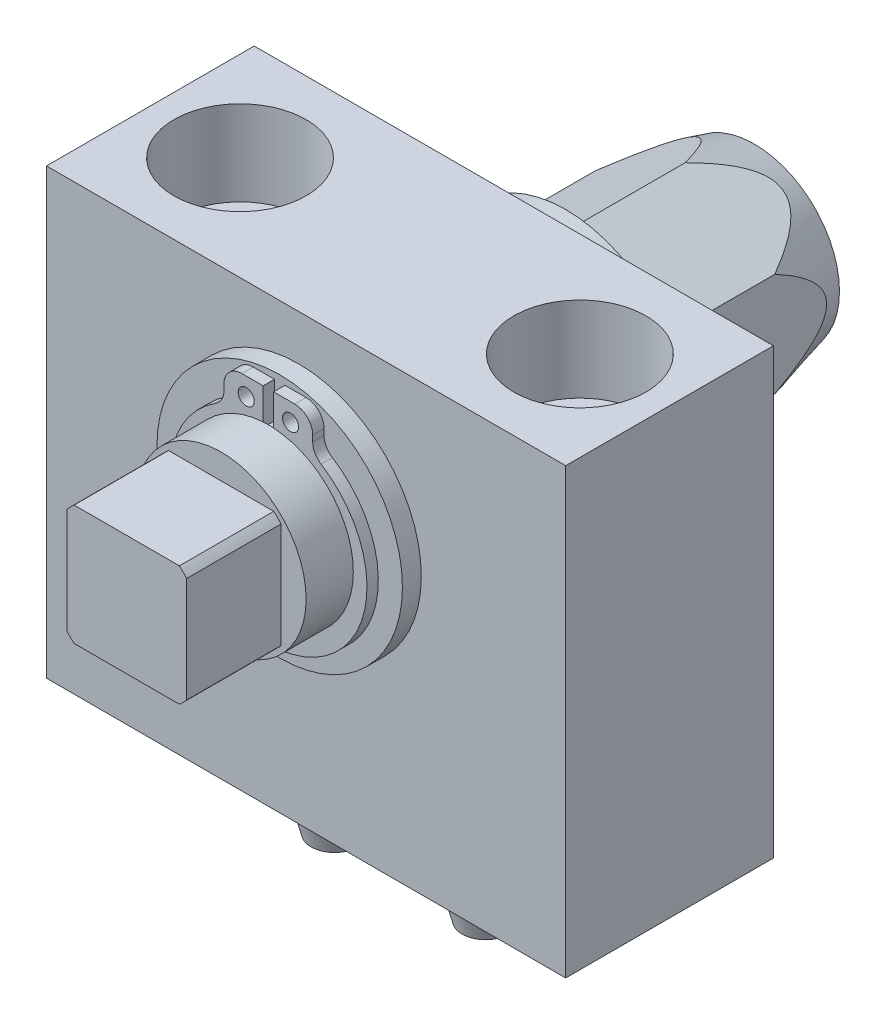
ISO-10303-21;
HEADER;
FILE_DESCRIPTION(('STEP AP214'),'2;1');
FILE_NAME('part.step','',(''),(''),'','','');
FILE_SCHEMA(('AUTOMOTIVE_DESIGN { 1 0 10303 214 1 1 1 1 }'));
ENDSEC;
DATA;
#1=APPLICATION_CONTEXT('core data for automotive mechanical design processes');
#2=APPLICATION_PROTOCOL_DEFINITION('international standard','automotive_design',2000,#1);
#3=PRODUCT_CONTEXT('',#1,'mechanical');
#4=PRODUCT('Part','Part','',(#3));
#5=PRODUCT_RELATED_PRODUCT_CATEGORY('part','',(#4));
#6=PRODUCT_DEFINITION_FORMATION('','',#4);
#7=PRODUCT_DEFINITION_CONTEXT('part definition',#1,'design');
#8=PRODUCT_DEFINITION('design','',#6,#7);
#9=PRODUCT_DEFINITION_SHAPE('','',#8);
#10=(LENGTH_UNIT() NAMED_UNIT(*) SI_UNIT(.MILLI.,.METRE.));
#11=(NAMED_UNIT(*) PLANE_ANGLE_UNIT() SI_UNIT($,.RADIAN.));
#12=(NAMED_UNIT(*) SI_UNIT($,.STERADIAN.) SOLID_ANGLE_UNIT());
#13=UNCERTAINTY_MEASURE_WITH_UNIT(LENGTH_MEASURE(1.E-05),#10,'distance_accuracy_value','');
#14=(GEOMETRIC_REPRESENTATION_CONTEXT(3) GLOBAL_UNCERTAINTY_ASSIGNED_CONTEXT((#13)) GLOBAL_UNIT_ASSIGNED_CONTEXT((#10,
#11,#12)) REPRESENTATION_CONTEXT('',''));
#15=CARTESIAN_POINT('',(0.,0.,0.));
#16=DIRECTION('',(0.,0.,1.));
#17=DIRECTION('',(1.,0.,0.));
#18=AXIS2_PLACEMENT_3D('',#15,#16,#17);
#19=CARTESIAN_POINT('',(-18.,47.,0.));
#20=DIRECTION('',(0.,-1.,0.));
#21=DIRECTION('',(0.,0.,-1.));
#22=AXIS2_PLACEMENT_3D('',#19,#20,#21);
#23=CYLINDRICAL_SURFACE('',#22,4.5);
#24=CARTESIAN_POINT('',(-18.,0.,0.));
#25=DIRECTION('',(0.,1.,0.));
#26=DIRECTION('',(0.,0.,1.));
#27=AXIS2_PLACEMENT_3D('',#24,#25,#26);
#28=CIRCLE('',#27,4.5);
#29=CARTESIAN_POINT('',(-18.,0.,4.5));
#30=VERTEX_POINT('',#29);
#31=EDGE_CURVE('P0_E136',#30,#30,#28,.T.);
#32=ORIENTED_EDGE('',*,*,#31,.F.);
#33=EDGE_LOOP('',(#32));
#34=FACE_BOUND('',#33,.T.);
#35=CARTESIAN_POINT('',(-18.,38.,0.));
#36=DIRECTION('',(0.,1.,0.));
#37=DIRECTION('',(0.,0.,1.));
#38=AXIS2_PLACEMENT_3D('',#35,#36,#37);
#39=CIRCLE('',#38,4.5);
#40=CARTESIAN_POINT('',(-18.,38.,4.5));
#41=VERTEX_POINT('',#40);
#42=EDGE_CURVE('P0_E111',#41,#41,#39,.T.);
#43=ORIENTED_EDGE('',*,*,#42,.T.);
#44=EDGE_LOOP('',(#43));
#45=FACE_BOUND('',#44,.T.);
#46=ADVANCED_FACE('P0_F16',(#34,#45),#23,.F.);
#47=CARTESIAN_POINT('',(18.,47.,0.));
#48=DIRECTION('',(0.,-1.,0.));
#49=DIRECTION('',(0.,0.,-1.));
#50=AXIS2_PLACEMENT_3D('',#47,#48,#49);
#51=CYLINDRICAL_SURFACE('',#50,4.5);
#52=CARTESIAN_POINT('',(18.,0.,0.));
#53=DIRECTION('',(0.,1.,0.));
#54=DIRECTION('',(0.,0.,1.));
#55=AXIS2_PLACEMENT_3D('',#52,#53,#54);
#56=CIRCLE('',#55,4.5);
#57=CARTESIAN_POINT('',(18.,0.,4.49999999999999));
#58=VERTEX_POINT('',#57);
#59=EDGE_CURVE('P0_E128',#58,#58,#56,.T.);
#60=ORIENTED_EDGE('',*,*,#59,.F.);
#61=EDGE_LOOP('',(#60));
#62=FACE_BOUND('',#61,.T.);
#63=CARTESIAN_POINT('',(18.,38.,0.));
#64=DIRECTION('',(0.,1.,0.));
#65=DIRECTION('',(0.,0.,1.));
#66=AXIS2_PLACEMENT_3D('',#63,#64,#65);
#67=CIRCLE('',#66,4.5);
#68=CARTESIAN_POINT('',(18.,38.,4.49999999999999));
#69=VERTEX_POINT('',#68);
#70=EDGE_CURVE('P0_E119',#69,#69,#67,.T.);
#71=ORIENTED_EDGE('',*,*,#70,.T.);
#72=EDGE_LOOP('',(#71));
#73=FACE_BOUND('',#72,.T.);
#74=ADVANCED_FACE('P0_F230',(#62,#73),#51,.F.);
#75=CARTESIAN_POINT('',(0.,47.,0.));
#76=DIRECTION('',(0.,-1.,0.));
#77=DIRECTION('',(0.,0.,-1.));
#78=AXIS2_PLACEMENT_3D('',#75,#76,#77);
#79=PLANE('',#78);
#80=CARTESIAN_POINT('',(-18.,47.,0.));
#81=DIRECTION('',(0.,1.,0.));
#82=DIRECTION('',(0.,0.,1.));
#83=AXIS2_PLACEMENT_3D('',#80,#81,#82);
#84=CIRCLE('',#83,7.);
#85=CARTESIAN_POINT('',(-18.,47.,7.));
#86=VERTEX_POINT('',#85);
#87=EDGE_CURVE('P0_E106',#86,#86,#84,.T.);
#88=ORIENTED_EDGE('',*,*,#87,.F.);
#89=EDGE_LOOP('',(#88));
#90=FACE_BOUND('',#89,.T.);
#91=CARTESIAN_POINT('',(18.,47.,0.));
#92=DIRECTION('',(0.,1.,0.));
#93=DIRECTION('',(0.,0.,1.));
#94=AXIS2_PLACEMENT_3D('',#91,#92,#93);
#95=CIRCLE('',#94,7.);
#96=CARTESIAN_POINT('',(18.,47.,6.99999999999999));
#97=VERTEX_POINT('',#96);
#98=EDGE_CURVE('P0_E120',#97,#97,#95,.T.);
#99=ORIENTED_EDGE('',*,*,#98,.F.);
#100=EDGE_LOOP('',(#99));
#101=FACE_BOUND('',#100,.T.);
#102=DIRECTION('',(0.,0.,-1.));
#103=VECTOR('',#102,1.);
#104=CARTESIAN_POINT('',(27.5,47.,11.));
#105=LINE('',#104,#103);
#106=CARTESIAN_POINT('',(27.5,47.,11.));
#107=VERTEX_POINT('',#106);
#108=CARTESIAN_POINT('',(27.5,47.,-11.));
#109=VERTEX_POINT('',#108);
#110=EDGE_CURVE('P0_E141',#107,#109,#105,.T.);
#111=ORIENTED_EDGE('',*,*,#110,.T.);
#112=DIRECTION('',(-1.,0.,0.));
#113=VECTOR('',#112,1.);
#114=CARTESIAN_POINT('',(-27.5,47.,-11.));
#115=LINE('',#114,#113);
#116=CARTESIAN_POINT('',(-27.5,47.,-11.));
#117=VERTEX_POINT('',#116);
#118=EDGE_CURVE('P0_E67',#109,#117,#115,.T.);
#119=ORIENTED_EDGE('',*,*,#118,.T.);
#120=DIRECTION('',(0.,0.,1.));
#121=VECTOR('',#120,1.);
#122=CARTESIAN_POINT('',(-27.5,47.,11.));
#123=LINE('',#122,#121);
#124=CARTESIAN_POINT('',(-27.5,47.,11.));
#125=VERTEX_POINT('',#124);
#126=EDGE_CURVE('P0_E146',#117,#125,#123,.T.);
#127=ORIENTED_EDGE('',*,*,#126,.T.);
#128=DIRECTION('',(1.,0.,0.));
#129=VECTOR('',#128,1.);
#130=CARTESIAN_POINT('',(-27.5,47.,11.));
#131=LINE('',#130,#129);
#132=EDGE_CURVE('P0_E35',#125,#107,#131,.T.);
#133=ORIENTED_EDGE('',*,*,#132,.T.);
#134=EDGE_LOOP('',(#111,#119,#127,#133));
#135=FACE_BOUND('',#134,.T.);
#136=ADVANCED_FACE('P0_F236',(#90,#101,#135),#79,.F.);
#137=CARTESIAN_POINT('',(0.,0.,0.));
#138=DIRECTION('',(0.,-1.,0.));
#139=DIRECTION('',(0.,0.,-1.));
#140=AXIS2_PLACEMENT_3D('',#137,#138,#139);
#141=PLANE('',#140);
#142=CARTESIAN_POINT('',(-8.,0.,0.));
#143=DIRECTION('',(0.,-1.,0.));
#144=DIRECTION('',(0.,0.,-1.));
#145=AXIS2_PLACEMENT_3D('',#142,#143,#144);
#146=CIRCLE('',#145,3.);
#147=CARTESIAN_POINT('',(-8.,0.,-3.));
#148=VERTEX_POINT('',#147);
#149=EDGE_CURVE('P0_E88',#148,#148,#146,.T.);
#150=ORIENTED_EDGE('',*,*,#149,.F.);
#151=EDGE_LOOP('',(#150));
#152=FACE_BOUND('',#151,.T.);
#153=CARTESIAN_POINT('',(8.,0.,0.));
#154=DIRECTION('',(0.,-1.,0.));
#155=DIRECTION('',(0.,0.,-1.));
#156=AXIS2_PLACEMENT_3D('',#153,#154,#155);
#157=CIRCLE('',#156,3.);
#158=CARTESIAN_POINT('',(8.,0.,-3.));
#159=VERTEX_POINT('',#158);
#160=EDGE_CURVE('P0_E87',#159,#159,#157,.T.);
#161=ORIENTED_EDGE('',*,*,#160,.F.);
#162=EDGE_LOOP('',(#161));
#163=FACE_BOUND('',#162,.T.);
#164=ORIENTED_EDGE('',*,*,#31,.T.);
#165=EDGE_LOOP('',(#164));
#166=FACE_BOUND('',#165,.T.);
#167=DIRECTION('',(0.,0.,-1.));
#168=VECTOR('',#167,1.);
#169=CARTESIAN_POINT('',(27.5,0.,11.));
#170=LINE('',#169,#168);
#171=CARTESIAN_POINT('',(27.5,0.,11.));
#172=VERTEX_POINT('',#171);
#173=CARTESIAN_POINT('',(27.5,0.,-11.));
#174=VERTEX_POINT('',#173);
#175=EDGE_CURVE('P0_E140',#172,#174,#170,.T.);
#176=ORIENTED_EDGE('',*,*,#175,.F.);
#177=DIRECTION('',(1.,0.,0.));
#178=VECTOR('',#177,1.);
#179=CARTESIAN_POINT('',(-27.5,0.,11.));
#180=LINE('',#179,#178);
#181=CARTESIAN_POINT('',(-27.5,0.,11.));
#182=VERTEX_POINT('',#181);
#183=EDGE_CURVE('P0_E59',#182,#172,#180,.T.);
#184=ORIENTED_EDGE('',*,*,#183,.F.);
#185=DIRECTION('',(0.,0.,1.));
#186=VECTOR('',#185,1.);
#187=CARTESIAN_POINT('',(-27.5,0.,11.));
#188=LINE('',#187,#186);
#189=CARTESIAN_POINT('',(-27.5,0.,-11.));
#190=VERTEX_POINT('',#189);
#191=EDGE_CURVE('P0_E53',#190,#182,#188,.T.);
#192=ORIENTED_EDGE('',*,*,#191,.F.);
#193=DIRECTION('',(-1.,0.,0.));
#194=VECTOR('',#193,1.);
#195=CARTESIAN_POINT('',(-27.5,0.,-11.));
#196=LINE('',#195,#194);
#197=EDGE_CURVE('P0_E155',#174,#190,#196,.T.);
#198=ORIENTED_EDGE('',*,*,#197,.F.);
#199=EDGE_LOOP('',(#176,#184,#192,#198));
#200=FACE_BOUND('',#199,.T.);
#201=ORIENTED_EDGE('',*,*,#59,.T.);
#202=EDGE_LOOP('',(#201));
#203=FACE_BOUND('',#202,.T.);
#204=ADVANCED_FACE('P0_F245',(#152,#163,#166,#200,#203),#141,.T.);
#205=CARTESIAN_POINT('',(27.5,47.,11.));
#206=DIRECTION('',(-1.,0.,0.));
#207=DIRECTION('',(0.,0.,1.));
#208=AXIS2_PLACEMENT_3D('',#205,#206,#207);
#209=PLANE('',#208);
#210=ORIENTED_EDGE('',*,*,#175,.T.);
#211=DIRECTION('',(0.,-1.,0.));
#212=VECTOR('',#211,1.);
#213=CARTESIAN_POINT('',(27.5,47.,-11.));
#214=LINE('',#213,#212);
#215=EDGE_CURVE('P0_E170',#109,#174,#214,.T.);
#216=ORIENTED_EDGE('',*,*,#215,.F.);
#217=ORIENTED_EDGE('',*,*,#110,.F.);
#218=DIRECTION('',(0.,-1.,0.));
#219=VECTOR('',#218,1.);
#220=CARTESIAN_POINT('',(27.5,47.,11.));
#221=LINE('',#220,#219);
#222=EDGE_CURVE('P0_E151',#107,#172,#221,.T.);
#223=ORIENTED_EDGE('',*,*,#222,.T.);
#224=EDGE_LOOP('',(#210,#216,#217,#223));
#225=FACE_BOUND('',#224,.T.);
#226=ADVANCED_FACE('P0_F18',(#225),#209,.F.);
#227=CARTESIAN_POINT('',(-27.5,47.,-11.));
#228=DIRECTION('',(0.,0.,1.));
#229=DIRECTION('',(1.,0.,0.));
#230=AXIS2_PLACEMENT_3D('',#227,#228,#229);
#231=PLANE('',#230);
#232=CARTESIAN_POINT('',(0.,30.,-11.));
#233=DIRECTION('',(0.,0.,1.));
#234=DIRECTION('',(1.,0.,0.));
#235=AXIS2_PLACEMENT_3D('',#232,#233,#234);
#236=CIRCLE('',#235,10.);
#237=CARTESIAN_POINT('',(10.,30.,-11.));
#238=VERTEX_POINT('',#237);
#239=EDGE_CURVE('P0_E124',#238,#238,#236,.T.);
#240=ORIENTED_EDGE('',*,*,#239,.T.);
#241=EDGE_LOOP('',(#240));
#242=FACE_BOUND('',#241,.T.);
#243=ORIENTED_EDGE('',*,*,#197,.T.);
#244=DIRECTION('',(0.,-1.,0.));
#245=VECTOR('',#244,1.);
#246=CARTESIAN_POINT('',(-27.5,47.,-11.));
#247=LINE('',#246,#245);
#248=EDGE_CURVE('P0_E167',#117,#190,#247,.T.);
#249=ORIENTED_EDGE('',*,*,#248,.F.);
#250=ORIENTED_EDGE('',*,*,#118,.F.);
#251=ORIENTED_EDGE('',*,*,#215,.T.);
#252=EDGE_LOOP('',(#243,#249,#250,#251));
#253=FACE_BOUND('',#252,.T.);
#254=ADVANCED_FACE('P0_F257',(#242,#253),#231,.F.);
#255=CARTESIAN_POINT('',(-27.5,47.,11.));
#256=DIRECTION('',(1.,0.,0.));
#257=DIRECTION('',(0.,0.,-1.));
#258=AXIS2_PLACEMENT_3D('',#255,#256,#257);
#259=PLANE('',#258);
#260=ORIENTED_EDGE('',*,*,#191,.T.);
#261=DIRECTION('',(0.,-1.,0.));
#262=VECTOR('',#261,1.);
#263=CARTESIAN_POINT('',(-27.5,47.,11.));
#264=LINE('',#263,#262);
#265=EDGE_CURVE('P0_E164',#125,#182,#264,.T.);
#266=ORIENTED_EDGE('',*,*,#265,.F.);
#267=ORIENTED_EDGE('',*,*,#126,.F.);
#268=ORIENTED_EDGE('',*,*,#248,.T.);
#269=EDGE_LOOP('',(#260,#266,#267,#268));
#270=FACE_BOUND('',#269,.T.);
#271=ADVANCED_FACE('P0_F254',(#270),#259,.F.);
#272=CARTESIAN_POINT('',(-27.5,47.,11.));
#273=DIRECTION('',(0.,0.,-1.));
#274=DIRECTION('',(-1.,0.,0.));
#275=AXIS2_PLACEMENT_3D('',#272,#273,#274);
#276=PLANE('',#275);
#277=CARTESIAN_POINT('',(0.,30.,11.));
#278=DIRECTION('',(0.,0.,1.));
#279=DIRECTION('',(1.,0.,0.));
#280=AXIS2_PLACEMENT_3D('',#277,#278,#279);
#281=CIRCLE('',#280,10.);
#282=CARTESIAN_POINT('',(10.,30.,11.));
#283=VERTEX_POINT('',#282);
#284=EDGE_CURVE('P0_E129',#283,#283,#281,.T.);
#285=ORIENTED_EDGE('',*,*,#284,.F.);
#286=EDGE_LOOP('',(#285));
#287=FACE_BOUND('',#286,.T.);
#288=ORIENTED_EDGE('',*,*,#183,.T.);
#289=ORIENTED_EDGE('',*,*,#222,.F.);
#290=ORIENTED_EDGE('',*,*,#132,.F.);
#291=ORIENTED_EDGE('',*,*,#265,.T.);
#292=EDGE_LOOP('',(#288,#289,#290,#291));
#293=FACE_BOUND('',#292,.T.);
#294=ADVANCED_FACE('P0_F250',(#287,#293),#276,.F.);
#295=CARTESIAN_POINT('',(0.,30.,-11.));
#296=DIRECTION('',(0.,0.,1.));
#297=DIRECTION('',(1.,0.,0.));
#298=AXIS2_PLACEMENT_3D('',#295,#296,#297);
#299=CYLINDRICAL_SURFACE('',#298,10.);
#300=ORIENTED_EDGE('',*,*,#239,.F.);
#301=EDGE_LOOP('',(#300));
#302=FACE_BOUND('',#301,.T.);
#303=ORIENTED_EDGE('',*,*,#284,.T.);
#304=EDGE_LOOP('',(#303));
#305=FACE_BOUND('',#304,.T.);
#306=ADVANCED_FACE('P0_F253',(#302,#305),#299,.F.);
#307=CARTESIAN_POINT('',(18.,38.,0.));
#308=DIRECTION('',(0.,1.,0.));
#309=DIRECTION('',(0.,0.,1.));
#310=AXIS2_PLACEMENT_3D('',#307,#308,#309);
#311=CYLINDRICAL_SURFACE('',#310,7.);
#312=CARTESIAN_POINT('',(18.,38.,0.));
#313=DIRECTION('',(0.,1.,0.));
#314=DIRECTION('',(0.,0.,1.));
#315=AXIS2_PLACEMENT_3D('',#312,#313,#314);
#316=CIRCLE('',#315,7.);
#317=CARTESIAN_POINT('',(18.,38.,6.99999999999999));
#318=VERTEX_POINT('',#317);
#319=EDGE_CURVE('P0_E115',#318,#318,#316,.T.);
#320=ORIENTED_EDGE('',*,*,#319,.F.);
#321=EDGE_LOOP('',(#320));
#322=FACE_BOUND('',#321,.T.);
#323=ORIENTED_EDGE('',*,*,#98,.T.);
#324=EDGE_LOOP('',(#323));
#325=FACE_BOUND('',#324,.T.);
#326=ADVANCED_FACE('P0_F279',(#322,#325),#311,.F.);
#327=CARTESIAN_POINT('',(18.,38.,0.));
#328=DIRECTION('',(0.,1.,0.));
#329=DIRECTION('',(0.,0.,1.));
#330=AXIS2_PLACEMENT_3D('',#327,#328,#329);
#331=PLANE('',#330);
#332=ORIENTED_EDGE('',*,*,#70,.F.);
#333=EDGE_LOOP('',(#332));
#334=FACE_BOUND('',#333,.T.);
#335=ORIENTED_EDGE('',*,*,#319,.T.);
#336=EDGE_LOOP('',(#335));
#337=FACE_BOUND('',#336,.T.);
#338=ADVANCED_FACE('P0_F275',(#334,#337),#331,.T.);
#339=CARTESIAN_POINT('',(-18.,38.,0.));
#340=DIRECTION('',(0.,1.,0.));
#341=DIRECTION('',(0.,0.,1.));
#342=AXIS2_PLACEMENT_3D('',#339,#340,#341);
#343=CYLINDRICAL_SURFACE('',#342,7.);
#344=CARTESIAN_POINT('',(-18.,38.,0.));
#345=DIRECTION('',(0.,1.,0.));
#346=DIRECTION('',(0.,0.,1.));
#347=AXIS2_PLACEMENT_3D('',#344,#345,#346);
#348=CIRCLE('',#347,7.);
#349=CARTESIAN_POINT('',(-18.,38.,7.));
#350=VERTEX_POINT('',#349);
#351=EDGE_CURVE('P0_E107',#350,#350,#348,.T.);
#352=ORIENTED_EDGE('',*,*,#351,.F.);
#353=EDGE_LOOP('',(#352));
#354=FACE_BOUND('',#353,.T.);
#355=ORIENTED_EDGE('',*,*,#87,.T.);
#356=EDGE_LOOP('',(#355));
#357=FACE_BOUND('',#356,.T.);
#358=ADVANCED_FACE('P0_F278',(#354,#357),#343,.F.);
#359=CARTESIAN_POINT('',(-18.,38.,0.));
#360=DIRECTION('',(0.,1.,0.));
#361=DIRECTION('',(0.,0.,1.));
#362=AXIS2_PLACEMENT_3D('',#359,#360,#361);
#363=PLANE('',#362);
#364=ORIENTED_EDGE('',*,*,#42,.F.);
#365=EDGE_LOOP('',(#364));
#366=FACE_BOUND('',#365,.T.);
#367=ORIENTED_EDGE('',*,*,#351,.T.);
#368=EDGE_LOOP('',(#367));
#369=FACE_BOUND('',#368,.T.);
#370=ADVANCED_FACE('P0_F200',(#366,#369),#363,.T.);
#371=CARTESIAN_POINT('',(-8.,20.,0.));
#372=DIRECTION('',(0.,1.,0.));
#373=DIRECTION('',(0.,0.,-1.));
#374=AXIS2_PLACEMENT_3D('',#371,#372,#373);
#375=CYLINDRICAL_SURFACE('',#374,3.);
#376=ORIENTED_EDGE('',*,*,#149,.T.);
#377=EDGE_LOOP('',(#376));
#378=FACE_BOUND('',#377,.T.);
#379=CARTESIAN_POINT('',(-8.,-8.,0.));
#380=DIRECTION('',(0.,1.,0.));
#381=DIRECTION('',(0.,0.,-1.));
#382=AXIS2_PLACEMENT_3D('',#379,#380,#381);
#383=CIRCLE('',#382,3.);
#384=CARTESIAN_POINT('',(-8.,-8.,-3.));
#385=VERTEX_POINT('',#384);
#386=EDGE_CURVE('P0_E99',#385,#385,#383,.T.);
#387=ORIENTED_EDGE('',*,*,#386,.T.);
#388=EDGE_LOOP('',(#387));
#389=FACE_BOUND('',#388,.T.);
#390=ADVANCED_FACE('P0_F196',(#378,#389),#375,.T.);
#391=CARTESIAN_POINT('',(-8.,-10.,0.));
#392=DIRECTION('',(0.,1.,0.));
#393=DIRECTION('',(0.,0.,-1.));
#394=AXIS2_PLACEMENT_3D('',#391,#392,#393);
#395=CONICAL_SURFACE('',#394,2.46410161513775,0.26179938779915);
#396=ORIENTED_EDGE('',*,*,#386,.F.);
#397=EDGE_LOOP('',(#396));
#398=FACE_BOUND('',#397,.T.);
#399=CARTESIAN_POINT('',(-8.,-10.,0.));
#400=DIRECTION('',(0.,1.,0.));
#401=DIRECTION('',(0.,0.,-1.));
#402=AXIS2_PLACEMENT_3D('',#399,#400,#401);
#403=CIRCLE('',#402,2.46410161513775);
#404=CARTESIAN_POINT('',(-8.,-10.,-2.46410161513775));
#405=VERTEX_POINT('',#404);
#406=EDGE_CURVE('P0_E574',#405,#405,#403,.T.);
#407=ORIENTED_EDGE('',*,*,#406,.T.);
#408=EDGE_LOOP('',(#407));
#409=FACE_BOUND('',#408,.T.);
#410=ADVANCED_FACE('P0_F199',(#398,#409),#395,.T.);
#411=CARTESIAN_POINT('',(-8.,-10.,0.));
#412=DIRECTION('',(0.,1.,0.));
#413=DIRECTION('',(0.,0.,-1.));
#414=AXIS2_PLACEMENT_3D('',#411,#412,#413);
#415=PLANE('',#414);
#416=ORIENTED_EDGE('',*,*,#406,.F.);
#417=EDGE_LOOP('',(#416));
#418=FACE_BOUND('',#417,.T.);
#419=ADVANCED_FACE('P0_F204',(#418),#415,.F.);
#420=CARTESIAN_POINT('',(8.,20.,0.));
#421=DIRECTION('',(0.,1.,0.));
#422=DIRECTION('',(0.,0.,-1.));
#423=AXIS2_PLACEMENT_3D('',#420,#421,#422);
#424=CYLINDRICAL_SURFACE('',#423,3.);
#425=ORIENTED_EDGE('',*,*,#160,.T.);
#426=EDGE_LOOP('',(#425));
#427=FACE_BOUND('',#426,.T.);
#428=CARTESIAN_POINT('',(8.,-8.,0.));
#429=DIRECTION('',(0.,1.,0.));
#430=DIRECTION('',(0.,0.,-1.));
#431=AXIS2_PLACEMENT_3D('',#428,#429,#430);
#432=CIRCLE('',#431,3.);
#433=CARTESIAN_POINT('',(8.,-8.,-3.));
#434=VERTEX_POINT('',#433);
#435=EDGE_CURVE('P0_E573',#434,#434,#432,.T.);
#436=ORIENTED_EDGE('',*,*,#435,.T.);
#437=EDGE_LOOP('',(#436));
#438=FACE_BOUND('',#437,.T.);
#439=ADVANCED_FACE('P0_F208',(#427,#438),#424,.T.);
#440=CARTESIAN_POINT('',(8.,-10.,0.));
#441=DIRECTION('',(0.,1.,0.));
#442=DIRECTION('',(0.,0.,-1.));
#443=AXIS2_PLACEMENT_3D('',#440,#441,#442);
#444=CONICAL_SURFACE('',#443,2.46410161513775,0.26179938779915);
#445=ORIENTED_EDGE('',*,*,#435,.F.);
#446=EDGE_LOOP('',(#445));
#447=FACE_BOUND('',#446,.T.);
#448=CARTESIAN_POINT('',(8.,-10.,0.));
#449=DIRECTION('',(0.,1.,0.));
#450=DIRECTION('',(0.,0.,-1.));
#451=AXIS2_PLACEMENT_3D('',#448,#449,#450);
#452=CIRCLE('',#451,2.46410161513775);
#453=CARTESIAN_POINT('',(8.,-10.,-2.46410161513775));
#454=VERTEX_POINT('',#453);
#455=EDGE_CURVE('P0_E575',#454,#454,#452,.T.);
#456=ORIENTED_EDGE('',*,*,#455,.T.);
#457=EDGE_LOOP('',(#456));
#458=FACE_BOUND('',#457,.T.);
#459=ADVANCED_FACE('P0_F218',(#447,#458),#444,.T.);
#460=CARTESIAN_POINT('',(8.,-10.,0.));
#461=DIRECTION('',(0.,1.,0.));
#462=DIRECTION('',(0.,0.,-1.));
#463=AXIS2_PLACEMENT_3D('',#460,#461,#462);
#464=PLANE('',#463);
#465=ORIENTED_EDGE('',*,*,#455,.F.);
#466=EDGE_LOOP('',(#465));
#467=FACE_BOUND('',#466,.T.);
#468=ADVANCED_FACE('P0_F222',(#467),#464,.F.);
#469=CLOSED_SHELL('',(#46,#74,#136,#204,#226,#254,#271,#294,#306,#326,#338,#358,#370,#390,#410,
#419,#439,#459,#468));
#470=CARTESIAN_POINT('',(8.,4.,0.));
#471=DIRECTION('',(0.,1.,0.));
#472=DIRECTION('',(0.,0.,1.));
#473=AXIS2_PLACEMENT_3D('',#470,#471,#472);
#474=SPHERICAL_SURFACE('',#473,6.);
#475=CARTESIAN_POINT('',(8.,9.19615242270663,0.));
#476=DIRECTION('',(0.,-1.,0.));
#477=DIRECTION('',(0.,0.,1.));
#478=AXIS2_PLACEMENT_3D('',#475,#476,#477);
#479=CIRCLE('',#478,3.);
#480=CARTESIAN_POINT('',(8.,9.19615242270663,3.));
#481=VERTEX_POINT('',#480);
#482=EDGE_CURVE('P0_E10',#481,#481,#479,.F.);
#483=ORIENTED_EDGE('',*,*,#482,.T.);
#484=EDGE_LOOP('',(#483));
#485=FACE_BOUND('',#484,.T.);
#486=ADVANCED_FACE('P0_F210',(#485),#474,.T.);
#487=CARTESIAN_POINT('',(8.,12.,0.));
#488=DIRECTION('',(0.,-1.,0.));
#489=DIRECTION('',(0.,0.,-1.));
#490=AXIS2_PLACEMENT_3D('',#487,#488,#489);
#491=CONICAL_SURFACE('',#490,3.,1.02974425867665);
#492=CARTESIAN_POINT('',(8.,13.8025818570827,0.));
#493=VERTEX_POINT('',#492);
#494=VERTEX_LOOP('',#493);
#495=FACE_BOUND('',#494,.T.);
#496=CARTESIAN_POINT('',(8.,12.,0.));
#497=DIRECTION('',(0.,-1.,0.));
#498=DIRECTION('',(0.,0.,-1.));
#499=AXIS2_PLACEMENT_3D('',#496,#497,#498);
#500=CIRCLE('',#499,3.);
#501=CARTESIAN_POINT('',(8.,12.,-3.));
#502=VERTEX_POINT('',#501);
#503=EDGE_CURVE('P0_E95',#502,#502,#500,.T.);
#504=ORIENTED_EDGE('',*,*,#503,.T.);
#505=EDGE_LOOP('',(#504));
#506=FACE_BOUND('',#505,.T.);
#507=ADVANCED_FACE('P0_F213',(#495,#506),#491,.F.);
#508=CARTESIAN_POINT('',(8.,0.,0.));
#509=DIRECTION('',(0.,-1.,0.));
#510=DIRECTION('',(0.,0.,-1.));
#511=AXIS2_PLACEMENT_3D('',#508,#509,#510);
#512=CYLINDRICAL_SURFACE('',#511,3.);
#513=ORIENTED_EDGE('',*,*,#503,.F.);
#514=EDGE_LOOP('',(#513));
#515=FACE_BOUND('',#514,.T.);
#516=ORIENTED_EDGE('',*,*,#482,.F.);
#517=EDGE_LOOP('',(#516));
#518=FACE_BOUND('',#517,.T.);
#519=ADVANCED_FACE('P0_F301',(#515,#518),#512,.F.);
#520=CLOSED_SHELL('',(#486,#507,#519));
#521=CARTESIAN_POINT('',(-8.,4.,0.));
#522=DIRECTION('',(0.,1.,0.));
#523=DIRECTION('',(0.,0.,1.));
#524=AXIS2_PLACEMENT_3D('',#521,#522,#523);
#525=SPHERICAL_SURFACE('',#524,6.);
#526=CARTESIAN_POINT('',(-8.,9.19615242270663,0.));
#527=DIRECTION('',(0.,-1.,0.));
#528=DIRECTION('',(0.,0.,1.));
#529=AXIS2_PLACEMENT_3D('',#526,#527,#528);
#530=CIRCLE('',#529,3.);
#531=CARTESIAN_POINT('',(-8.,9.19615242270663,3.));
#532=VERTEX_POINT('',#531);
#533=EDGE_CURVE('P0_E27',#532,#532,#530,.F.);
#534=ORIENTED_EDGE('',*,*,#533,.T.);
#535=EDGE_LOOP('',(#534));
#536=FACE_BOUND('',#535,.T.);
#537=ADVANCED_FACE('P0_F78',(#536),#525,.T.);
#538=CARTESIAN_POINT('',(-8.,12.,0.));
#539=DIRECTION('',(0.,-1.,0.));
#540=DIRECTION('',(0.,0.,-1.));
#541=AXIS2_PLACEMENT_3D('',#538,#539,#540);
#542=CONICAL_SURFACE('',#541,3.,1.02974425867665);
#543=CARTESIAN_POINT('',(-8.,13.8025818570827,0.));
#544=VERTEX_POINT('',#543);
#545=VERTEX_LOOP('',#544);
#546=FACE_BOUND('',#545,.T.);
#547=CARTESIAN_POINT('',(-8.,12.,0.));
#548=DIRECTION('',(0.,-1.,0.));
#549=DIRECTION('',(0.,0.,-1.));
#550=AXIS2_PLACEMENT_3D('',#547,#548,#549);
#551=CIRCLE('',#550,3.);
#552=CARTESIAN_POINT('',(-8.,12.,-3.));
#553=VERTEX_POINT('',#552);
#554=EDGE_CURVE('P0_E84',#553,#553,#551,.T.);
#555=ORIENTED_EDGE('',*,*,#554,.T.);
#556=EDGE_LOOP('',(#555));
#557=FACE_BOUND('',#556,.T.);
#558=ADVANCED_FACE('P0_F74',(#546,#557),#542,.F.);
#559=CARTESIAN_POINT('',(-8.,0.,0.));
#560=DIRECTION('',(0.,-1.,0.));
#561=DIRECTION('',(0.,0.,-1.));
#562=AXIS2_PLACEMENT_3D('',#559,#560,#561);
#563=CYLINDRICAL_SURFACE('',#562,3.);
#564=ORIENTED_EDGE('',*,*,#554,.F.);
#565=EDGE_LOOP('',(#564));
#566=FACE_BOUND('',#565,.T.);
#567=ORIENTED_EDGE('',*,*,#533,.F.);
#568=EDGE_LOOP('',(#567));
#569=FACE_BOUND('',#568,.T.);
#570=ADVANCED_FACE('P0_F77',(#566,#569),#563,.F.);
#571=CLOSED_SHELL('',(#537,#558,#570));
#572=ORIENTED_CLOSED_SHELL('',*,#520,.T.);
#573=ORIENTED_CLOSED_SHELL('',*,#571,.T.);
#574=BREP_WITH_VOIDS('P0_B1',#469,(#572,#573));
#575=CARTESIAN_POINT('',(6.59999999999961,39.788510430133,13.8));
#576=DIRECTION('',(0.,0.,1.));
#577=DIRECTION('',(-1.,0.,0.));
#578=AXIS2_PLACEMENT_3D('',#575,#576,#577);
#579=PLANE('',#578);
#580=CARTESIAN_POINT('',(0.,30.,13.8));
#581=DIRECTION('',(0.,0.,1.));
#582=DIRECTION('',(1.,0.,0.));
#583=AXIS2_PLACEMENT_3D('',#580,#581,#582);
#584=CIRCLE('',#583,9.);
#585=CARTESIAN_POINT('',(-0.549999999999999,38.9831787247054,13.8));
#586=VERTEX_POINT('',#585);
#587=CARTESIAN_POINT('',(0.550000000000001,38.9831787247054,13.8));
#588=VERTEX_POINT('',#587);
#589=EDGE_CURVE('P1_E10',#586,#588,#584,.T.);
#590=ORIENTED_EDGE('',*,*,#589,.F.);
#591=DIRECTION('',(0.,-1.,0.));
#592=VECTOR('',#591,1.);
#593=CARTESIAN_POINT('',(-0.549999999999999,42.3,13.8));
#594=LINE('',#593,#592);
#595=CARTESIAN_POINT('',(-0.549999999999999,38.4821872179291,13.8));
#596=VERTEX_POINT('',#595);
#597=EDGE_CURVE('P1_E304',#586,#596,#594,.T.);
#598=ORIENTED_EDGE('',*,*,#597,.T.);
#599=CARTESIAN_POINT('',(0.,30.,13.8));
#600=DIRECTION('',(0.,0.,1.));
#601=DIRECTION('',(-1.,0.,0.));
#602=AXIS2_PLACEMENT_3D('',#599,#600,#601);
#603=CIRCLE('',#602,8.5);
#604=CARTESIAN_POINT('',(0.550000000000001,38.4821872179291,13.8));
#605=VERTEX_POINT('',#604);
#606=EDGE_CURVE('P1_E308',#596,#605,#603,.T.);
#607=ORIENTED_EDGE('',*,*,#606,.T.);
#608=DIRECTION('',(0.,1.,0.));
#609=VECTOR('',#608,1.);
#610=CARTESIAN_POINT('',(0.550000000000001,38.4821872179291,13.8));
#611=LINE('',#610,#609);
#612=EDGE_CURVE('P1_E312',#605,#588,#611,.T.);
#613=ORIENTED_EDGE('',*,*,#612,.T.);
#614=EDGE_LOOP('',(#590,#598,#607,#613));
#615=FACE_BOUND('',#614,.T.);
#616=ADVANCED_FACE('P1_F15',(#615),#579,.F.);
#617=CARTESIAN_POINT('',(2.35,40.4,13.8));
#618=DIRECTION('',(0.,0.,1.));
#619=DIRECTION('',(-1.,0.,0.));
#620=AXIS2_PLACEMENT_3D('',#617,#618,#619);
#621=CYLINDRICAL_SURFACE('',#620,0.85);
#622=CARTESIAN_POINT('',(2.35,40.4,13.8));
#623=DIRECTION('',(0.,0.,-1.));
#624=DIRECTION('',(1.,0.,0.));
#625=AXIS2_PLACEMENT_3D('',#622,#623,#624);
#626=CIRCLE('',#625,0.85);
#627=CARTESIAN_POINT('',(3.2,40.4,13.8));
#628=VERTEX_POINT('',#627);
#629=EDGE_CURVE('P1_E277',#628,#628,#626,.T.);
#630=ORIENTED_EDGE('',*,*,#629,.T.);
#631=EDGE_LOOP('',(#630));
#632=FACE_BOUND('',#631,.T.);
#633=CARTESIAN_POINT('',(2.35,40.4,15.));
#634=DIRECTION('',(0.,0.,-1.));
#635=DIRECTION('',(1.,0.,0.));
#636=AXIS2_PLACEMENT_3D('',#633,#634,#635);
#637=CIRCLE('',#636,0.85);
#638=CARTESIAN_POINT('',(3.2,40.4,15.));
#639=VERTEX_POINT('',#638);
#640=EDGE_CURVE('P1_E753',#639,#639,#637,.T.);
#641=ORIENTED_EDGE('',*,*,#640,.F.);
#642=EDGE_LOOP('',(#641));
#643=FACE_BOUND('',#642,.T.);
#644=ADVANCED_FACE('P1_F764',(#632,#643),#621,.F.);
#645=CARTESIAN_POINT('',(-2.35,40.4,13.8));
#646=DIRECTION('',(0.,0.,1.));
#647=DIRECTION('',(-1.,0.,0.));
#648=AXIS2_PLACEMENT_3D('',#645,#646,#647);
#649=CYLINDRICAL_SURFACE('',#648,0.85);
#650=CARTESIAN_POINT('',(-2.35,40.4,13.8));
#651=DIRECTION('',(0.,0.,-1.));
#652=DIRECTION('',(1.,0.,0.));
#653=AXIS2_PLACEMENT_3D('',#650,#651,#652);
#654=CIRCLE('',#653,0.85);
#655=CARTESIAN_POINT('',(-1.5,40.4,13.8));
#656=VERTEX_POINT('',#655);
#657=EDGE_CURVE('P1_E273',#656,#656,#654,.T.);
#658=ORIENTED_EDGE('',*,*,#657,.T.);
#659=EDGE_LOOP('',(#658));
#660=FACE_BOUND('',#659,.T.);
#661=CARTESIAN_POINT('',(-2.35,40.4,15.));
#662=DIRECTION('',(0.,0.,-1.));
#663=DIRECTION('',(1.,0.,0.));
#664=AXIS2_PLACEMENT_3D('',#661,#662,#663);
#665=CIRCLE('',#664,0.85);
#666=CARTESIAN_POINT('',(-1.5,40.4,15.));
#667=VERTEX_POINT('',#666);
#668=EDGE_CURVE('P1_E379',#667,#667,#665,.T.);
#669=ORIENTED_EDGE('',*,*,#668,.F.);
#670=EDGE_LOOP('',(#669));
#671=FACE_BOUND('',#670,.T.);
#672=ADVANCED_FACE('P1_F762',(#660,#671),#649,.F.);
#673=CARTESIAN_POINT('',(0.550000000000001,38.4821872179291,13.8));
#674=DIRECTION('',(1.,0.,0.));
#675=DIRECTION('',(0.,0.,1.));
#676=AXIS2_PLACEMENT_3D('',#673,#674,#675);
#677=PLANE('',#676);
#678=DIRECTION('',(0.,0.,1.));
#679=VECTOR('',#678,1.);
#680=CARTESIAN_POINT('',(0.550000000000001,38.4821872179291,13.8));
#681=LINE('',#680,#679);
#682=CARTESIAN_POINT('',(0.550000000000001,38.4821872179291,15.));
#683=VERTEX_POINT('',#682);
#684=EDGE_CURVE('P1_E340',#605,#683,#681,.T.);
#685=ORIENTED_EDGE('',*,*,#684,.T.);
#686=DIRECTION('',(0.,1.,0.));
#687=VECTOR('',#686,1.);
#688=CARTESIAN_POINT('',(0.550000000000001,38.4821872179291,15.));
#689=LINE('',#688,#687);
#690=CARTESIAN_POINT('',(0.550000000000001,38.9831787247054,15.));
#691=VERTEX_POINT('',#690);
#692=EDGE_CURVE('P1_E255',#683,#691,#689,.T.);
#693=ORIENTED_EDGE('',*,*,#692,.T.);
#694=CARTESIAN_POINT('',(0.550000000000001,42.3,15.));
#695=VERTEX_POINT('',#694);
#696=EDGE_CURVE('P1_E223',#691,#695,#689,.T.);
#697=ORIENTED_EDGE('',*,*,#696,.T.);
#698=DIRECTION('',(0.,0.,1.));
#699=VECTOR('',#698,1.);
#700=CARTESIAN_POINT('',(0.550000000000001,42.3,13.8));
#701=LINE('',#700,#699);
#702=CARTESIAN_POINT('',(0.550000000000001,42.3,13.8));
#703=VERTEX_POINT('',#702);
#704=EDGE_CURVE('P1_E336',#703,#695,#701,.T.);
#705=ORIENTED_EDGE('',*,*,#704,.F.);
#706=EDGE_CURVE('P1_E311',#588,#703,#611,.T.);
#707=ORIENTED_EDGE('',*,*,#706,.F.);
#708=ORIENTED_EDGE('',*,*,#612,.F.);
#709=EDGE_LOOP('',(#685,#693,#697,#705,#707,#708));
#710=FACE_BOUND('',#709,.T.);
#711=ADVANCED_FACE('P1_F721',(#710),#677,.F.);
#712=CARTESIAN_POINT('',(0.550000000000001,42.3,13.8));
#713=DIRECTION('',(0.,-1.,0.));
#714=DIRECTION('',(-1.,0.,0.));
#715=AXIS2_PLACEMENT_3D('',#712,#713,#714);
#716=PLANE('',#715);
#717=ORIENTED_EDGE('',*,*,#704,.T.);
#718=DIRECTION('',(1.,0.,0.));
#719=VECTOR('',#718,1.);
#720=CARTESIAN_POINT('',(0.550000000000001,42.3,15.));
#721=LINE('',#720,#719);
#722=CARTESIAN_POINT('',(2.8,42.3,15.));
#723=VERTEX_POINT('',#722);
#724=EDGE_CURVE('P1_E261',#695,#723,#721,.T.);
#725=ORIENTED_EDGE('',*,*,#724,.T.);
#726=DIRECTION('',(0.,0.,1.));
#727=VECTOR('',#726,1.);
#728=CARTESIAN_POINT('',(2.8,42.3,13.8));
#729=LINE('',#728,#727);
#730=CARTESIAN_POINT('',(2.8,42.3,13.8));
#731=VERTEX_POINT('',#730);
#732=EDGE_CURVE('P1_E333',#731,#723,#729,.T.);
#733=ORIENTED_EDGE('',*,*,#732,.F.);
#734=DIRECTION('',(1.,0.,0.));
#735=VECTOR('',#734,1.);
#736=CARTESIAN_POINT('',(0.550000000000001,42.3,13.8));
#737=LINE('',#736,#735);
#738=EDGE_CURVE('P1_E315',#703,#731,#737,.T.);
#739=ORIENTED_EDGE('',*,*,#738,.F.);
#740=EDGE_LOOP('',(#717,#725,#733,#739));
#741=FACE_BOUND('',#740,.T.);
#742=ADVANCED_FACE('P1_F771',(#741),#716,.F.);
#743=CARTESIAN_POINT('',(2.79999999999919,40.3999999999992,13.8));
#744=DIRECTION('',(0.,0.,1.));
#745=DIRECTION('',(-1.,0.,0.));
#746=AXIS2_PLACEMENT_3D('',#743,#744,#745);
#747=CYLINDRICAL_SURFACE('',#746,1.90000000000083);
#748=ORIENTED_EDGE('',*,*,#732,.T.);
#749=CARTESIAN_POINT('',(2.79999999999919,40.3999999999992,15.));
#750=DIRECTION('',(0.,0.,-1.));
#751=DIRECTION('',(1.,0.,0.));
#752=AXIS2_PLACEMENT_3D('',#749,#750,#751);
#753=CIRCLE('',#752,1.90000000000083);
#754=CARTESIAN_POINT('',(4.7,40.3999999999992,15.));
#755=VERTEX_POINT('',#754);
#756=EDGE_CURVE('P1_E265',#723,#755,#753,.T.);
#757=ORIENTED_EDGE('',*,*,#756,.T.);
#758=DIRECTION('',(0.,0.,1.));
#759=VECTOR('',#758,1.);
#760=CARTESIAN_POINT('',(4.7,40.3999999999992,13.8));
#761=LINE('',#760,#759);
#762=CARTESIAN_POINT('',(4.7,40.3999999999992,13.8));
#763=VERTEX_POINT('',#762);
#764=EDGE_CURVE('P1_E330',#763,#755,#761,.T.);
#765=ORIENTED_EDGE('',*,*,#764,.F.);
#766=CARTESIAN_POINT('',(2.79999999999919,40.3999999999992,13.8));
#767=DIRECTION('',(0.,0.,-1.));
#768=DIRECTION('',(1.,0.,0.));
#769=AXIS2_PLACEMENT_3D('',#766,#767,#768);
#770=CIRCLE('',#769,1.90000000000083);
#771=EDGE_CURVE('P1_E319',#731,#763,#770,.T.);
#772=ORIENTED_EDGE('',*,*,#771,.F.);
#773=EDGE_LOOP('',(#748,#757,#765,#772));
#774=FACE_BOUND('',#773,.T.);
#775=ADVANCED_FACE('P1_F782',(#774),#747,.T.);
#776=CARTESIAN_POINT('',(4.7,40.4,13.8));
#777=DIRECTION('',(-1.,0.,0.));
#778=DIRECTION('',(0.,0.,-1.));
#779=AXIS2_PLACEMENT_3D('',#776,#777,#778);
#780=PLANE('',#779);
#781=ORIENTED_EDGE('',*,*,#764,.T.);
#782=DIRECTION('',(0.,-1.,0.));
#783=VECTOR('',#782,1.);
#784=CARTESIAN_POINT('',(4.7,40.4,15.));
#785=LINE('',#784,#783);
#786=CARTESIAN_POINT('',(4.7,39.7885104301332,15.));
#787=VERTEX_POINT('',#786);
#788=EDGE_CURVE('P1_E269',#755,#787,#785,.T.);
#789=ORIENTED_EDGE('',*,*,#788,.T.);
#790=DIRECTION('',(0.,0.,1.));
#791=VECTOR('',#790,1.);
#792=CARTESIAN_POINT('',(4.7,39.7885104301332,13.8));
#793=LINE('',#792,#791);
#794=CARTESIAN_POINT('',(4.7,39.7885104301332,13.8));
#795=VERTEX_POINT('',#794);
#796=EDGE_CURVE('P1_E327',#795,#787,#793,.T.);
#797=ORIENTED_EDGE('',*,*,#796,.F.);
#798=DIRECTION('',(0.,-1.,0.));
#799=VECTOR('',#798,1.);
#800=CARTESIAN_POINT('',(4.7,40.4,13.8));
#801=LINE('',#800,#799);
#802=EDGE_CURVE('P1_E323',#763,#795,#801,.T.);
#803=ORIENTED_EDGE('',*,*,#802,.F.);
#804=EDGE_LOOP('',(#781,#789,#797,#803));
#805=FACE_BOUND('',#804,.T.);
#806=ADVANCED_FACE('P1_F778',(#805),#780,.F.);
#807=CARTESIAN_POINT('',(6.59999999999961,39.788510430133,13.8));
#808=DIRECTION('',(0.,0.,1.));
#809=DIRECTION('',(-1.,0.,0.));
#810=AXIS2_PLACEMENT_3D('',#807,#808,#809);
#811=CYLINDRICAL_SURFACE('',#810,1.8999999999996);
#812=ORIENTED_EDGE('',*,*,#796,.T.);
#813=CARTESIAN_POINT('',(6.59999999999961,39.788510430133,15.));
#814=DIRECTION('',(0.,0.,1.));
#815=DIRECTION('',(-1.,0.,0.));
#816=AXIS2_PLACEMENT_3D('',#813,#814,#815);
#817=CIRCLE('',#816,1.8999999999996);
#818=CARTESIAN_POINT('',(5.58461534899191,38.1825857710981,15.));
#819=VERTEX_POINT('',#818);
#820=EDGE_CURVE('P1_E749',#787,#819,#817,.T.);
#821=ORIENTED_EDGE('',*,*,#820,.T.);
#822=DIRECTION('',(0.,0.,1.));
#823=VECTOR('',#822,1.);
#824=CARTESIAN_POINT('',(5.58461534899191,38.1825857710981,13.8));
#825=LINE('',#824,#823);
#826=CARTESIAN_POINT('',(5.58461534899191,38.1825857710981,13.8));
#827=VERTEX_POINT('',#826);
#828=EDGE_CURVE('P1_E138',#827,#819,#825,.T.);
#829=ORIENTED_EDGE('',*,*,#828,.F.);
#830=CARTESIAN_POINT('',(6.59999999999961,39.788510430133,13.8));
#831=DIRECTION('',(0.,0.,1.));
#832=DIRECTION('',(-1.,0.,0.));
#833=AXIS2_PLACEMENT_3D('',#830,#831,#832);
#834=CIRCLE('',#833,1.8999999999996);
#835=EDGE_CURVE('P1_E281',#795,#827,#834,.T.);
#836=ORIENTED_EDGE('',*,*,#835,.F.);
#837=EDGE_LOOP('',(#812,#821,#829,#836));
#838=FACE_BOUND('',#837,.T.);
#839=ADVANCED_FACE('P1_F781',(#838),#811,.F.);
#840=CARTESIAN_POINT('',(0.,29.35,13.8));
#841=DIRECTION('',(0.,0.,1.));
#842=DIRECTION('',(-1.,0.,0.));
#843=AXIS2_PLACEMENT_3D('',#840,#841,#842);
#844=CYLINDRICAL_SURFACE('',#843,10.45);
#845=ORIENTED_EDGE('',*,*,#828,.T.);
#846=CARTESIAN_POINT('',(0.,29.35,15.));
#847=DIRECTION('',(0.,0.,-1.));
#848=DIRECTION('',(1.,0.,0.));
#849=AXIS2_PLACEMENT_3D('',#846,#847,#848);
#850=CIRCLE('',#849,10.45);
#851=CARTESIAN_POINT('',(-5.58461521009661,38.182585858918,15.));
#852=VERTEX_POINT('',#851);
#853=EDGE_CURVE('P1_E744',#819,#852,#850,.T.);
#854=ORIENTED_EDGE('',*,*,#853,.T.);
#855=DIRECTION('',(0.,0.,1.));
#856=VECTOR('',#855,1.);
#857=CARTESIAN_POINT('',(-5.58461521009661,38.182585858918,13.8));
#858=LINE('',#857,#856);
#859=CARTESIAN_POINT('',(-5.58461521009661,38.182585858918,13.8));
#860=VERTEX_POINT('',#859);
#861=EDGE_CURVE('P1_E357',#860,#852,#858,.T.);
#862=ORIENTED_EDGE('',*,*,#861,.F.);
#863=CARTESIAN_POINT('',(0.,29.35,13.8));
#864=DIRECTION('',(0.,0.,-1.));
#865=DIRECTION('',(1.,0.,0.));
#866=AXIS2_PLACEMENT_3D('',#863,#864,#865);
#867=CIRCLE('',#866,10.45);
#868=EDGE_CURVE('P1_E285',#827,#860,#867,.T.);
#869=ORIENTED_EDGE('',*,*,#868,.F.);
#870=EDGE_LOOP('',(#845,#854,#862,#869));
#871=FACE_BOUND('',#870,.T.);
#872=ADVANCED_FACE('P1_F804',(#871),#844,.T.);
#873=CARTESIAN_POINT('',(-6.59999999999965,39.788510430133,13.8));
#874=DIRECTION('',(0.,0.,1.));
#875=DIRECTION('',(-1.,0.,0.));
#876=AXIS2_PLACEMENT_3D('',#873,#874,#875);
#877=CYLINDRICAL_SURFACE('',#876,1.89999999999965);
#878=ORIENTED_EDGE('',*,*,#861,.T.);
#879=CARTESIAN_POINT('',(-6.59999999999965,39.788510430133,15.));
#880=DIRECTION('',(0.,0.,1.));
#881=DIRECTION('',(-1.,0.,0.));
#882=AXIS2_PLACEMENT_3D('',#879,#880,#881);
#883=CIRCLE('',#882,1.89999999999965);
#884=CARTESIAN_POINT('',(-4.7,39.7885104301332,15.));
#885=VERTEX_POINT('',#884);
#886=EDGE_CURVE('P1_E737',#852,#885,#883,.T.);
#887=ORIENTED_EDGE('',*,*,#886,.T.);
#888=DIRECTION('',(0.,0.,1.));
#889=VECTOR('',#888,1.);
#890=CARTESIAN_POINT('',(-4.7,39.7885104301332,13.8));
#891=LINE('',#890,#889);
#892=CARTESIAN_POINT('',(-4.7,39.7885104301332,13.8));
#893=VERTEX_POINT('',#892);
#894=EDGE_CURVE('P1_E354',#893,#885,#891,.T.);
#895=ORIENTED_EDGE('',*,*,#894,.F.);
#896=CARTESIAN_POINT('',(-6.59999999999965,39.788510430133,13.8));
#897=DIRECTION('',(0.,0.,1.));
#898=DIRECTION('',(-1.,0.,0.));
#899=AXIS2_PLACEMENT_3D('',#896,#897,#898);
#900=CIRCLE('',#899,1.89999999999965);
#901=EDGE_CURVE('P1_E289',#860,#893,#900,.T.);
#902=ORIENTED_EDGE('',*,*,#901,.F.);
#903=EDGE_LOOP('',(#878,#887,#895,#902));
#904=FACE_BOUND('',#903,.T.);
#905=ADVANCED_FACE('P1_F801',(#904),#877,.F.);
#906=CARTESIAN_POINT('',(-4.7,39.7885104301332,13.8));
#907=DIRECTION('',(1.,0.,0.));
#908=DIRECTION('',(0.,0.,1.));
#909=AXIS2_PLACEMENT_3D('',#906,#907,#908);
#910=PLANE('',#909);
#911=ORIENTED_EDGE('',*,*,#894,.T.);
#912=DIRECTION('',(0.,1.,0.));
#913=VECTOR('',#912,1.);
#914=CARTESIAN_POINT('',(-4.7,39.7885104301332,15.));
#915=LINE('',#914,#913);
#916=CARTESIAN_POINT('',(-4.7,40.4,15.));
#917=VERTEX_POINT('',#916);
#918=EDGE_CURVE('P1_E714',#885,#917,#915,.T.);
#919=ORIENTED_EDGE('',*,*,#918,.T.);
#920=DIRECTION('',(0.,0.,1.));
#921=VECTOR('',#920,1.);
#922=CARTESIAN_POINT('',(-4.7,40.4,13.8));
#923=LINE('',#922,#921);
#924=CARTESIAN_POINT('',(-4.7,40.4,13.8));
#925=VERTEX_POINT('',#924);
#926=EDGE_CURVE('P1_E351',#925,#917,#923,.T.);
#927=ORIENTED_EDGE('',*,*,#926,.F.);
#928=DIRECTION('',(0.,1.,0.));
#929=VECTOR('',#928,1.);
#930=CARTESIAN_POINT('',(-4.7,39.7885104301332,13.8));
#931=LINE('',#930,#929);
#932=EDGE_CURVE('P1_E293',#893,#925,#931,.T.);
#933=ORIENTED_EDGE('',*,*,#932,.F.);
#934=EDGE_LOOP('',(#911,#919,#927,#933));
#935=FACE_BOUND('',#934,.T.);
#936=ADVANCED_FACE('P1_F797',(#935),#910,.F.);
#937=CARTESIAN_POINT('',(-2.79999999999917,40.3999999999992,13.8));
#938=DIRECTION('',(0.,0.,1.));
#939=DIRECTION('',(-1.,0.,0.));
#940=AXIS2_PLACEMENT_3D('',#937,#938,#939);
#941=CYLINDRICAL_SURFACE('',#940,1.90000000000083);
#942=ORIENTED_EDGE('',*,*,#926,.T.);
#943=CARTESIAN_POINT('',(-2.79999999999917,40.3999999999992,15.));
#944=DIRECTION('',(0.,0.,-1.));
#945=DIRECTION('',(1.,0.,0.));
#946=AXIS2_PLACEMENT_3D('',#943,#944,#945);
#947=CIRCLE('',#946,1.90000000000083);
#948=CARTESIAN_POINT('',(-2.8,42.3,15.));
#949=VERTEX_POINT('',#948);
#950=EDGE_CURVE('P1_E712',#917,#949,#947,.T.);
#951=ORIENTED_EDGE('',*,*,#950,.T.);
#952=DIRECTION('',(0.,0.,1.));
#953=VECTOR('',#952,1.);
#954=CARTESIAN_POINT('',(-2.8,42.3,13.8));
#955=LINE('',#954,#953);
#956=CARTESIAN_POINT('',(-2.8,42.3,13.8));
#957=VERTEX_POINT('',#956);
#958=EDGE_CURVE('P1_E348',#957,#949,#955,.T.);
#959=ORIENTED_EDGE('',*,*,#958,.F.);
#960=CARTESIAN_POINT('',(-2.79999999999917,40.3999999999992,13.8));
#961=DIRECTION('',(0.,0.,-1.));
#962=DIRECTION('',(1.,0.,0.));
#963=AXIS2_PLACEMENT_3D('',#960,#961,#962);
#964=CIRCLE('',#963,1.90000000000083);
#965=EDGE_CURVE('P1_E297',#925,#957,#964,.T.);
#966=ORIENTED_EDGE('',*,*,#965,.F.);
#967=EDGE_LOOP('',(#942,#951,#959,#966));
#968=FACE_BOUND('',#967,.T.);
#969=ADVANCED_FACE('P1_F794',(#968),#941,.T.);
#970=CARTESIAN_POINT('',(-2.8,42.3,13.8));
#971=DIRECTION('',(0.,-1.,0.));
#972=DIRECTION('',(-1.,0.,0.));
#973=AXIS2_PLACEMENT_3D('',#970,#971,#972);
#974=PLANE('',#973);
#975=ORIENTED_EDGE('',*,*,#958,.T.);
#976=DIRECTION('',(1.,0.,0.));
#977=VECTOR('',#976,1.);
#978=CARTESIAN_POINT('',(-2.8,42.3,15.));
#979=LINE('',#978,#977);
#980=CARTESIAN_POINT('',(-0.549999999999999,42.3,15.));
#981=VERTEX_POINT('',#980);
#982=EDGE_CURVE('P1_E241',#949,#981,#979,.T.);
#983=ORIENTED_EDGE('',*,*,#982,.T.);
#984=DIRECTION('',(0.,0.,1.));
#985=VECTOR('',#984,1.);
#986=CARTESIAN_POINT('',(-0.549999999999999,42.3,13.8));
#987=LINE('',#986,#985);
#988=CARTESIAN_POINT('',(-0.549999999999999,42.3,13.8));
#989=VERTEX_POINT('',#988);
#990=EDGE_CURVE('P1_E249',#989,#981,#987,.T.);
#991=ORIENTED_EDGE('',*,*,#990,.F.);
#992=DIRECTION('',(1.,0.,0.));
#993=VECTOR('',#992,1.);
#994=CARTESIAN_POINT('',(-2.8,42.3,13.8));
#995=LINE('',#994,#993);
#996=EDGE_CURVE('P1_E301',#957,#989,#995,.T.);
#997=ORIENTED_EDGE('',*,*,#996,.F.);
#998=EDGE_LOOP('',(#975,#983,#991,#997));
#999=FACE_BOUND('',#998,.T.);
#1000=ADVANCED_FACE('P1_F732',(#999),#974,.F.);
#1001=CARTESIAN_POINT('',(-0.549999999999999,42.3,13.8));
#1002=DIRECTION('',(-1.,0.,0.));
#1003=DIRECTION('',(0.,0.,-1.));
#1004=AXIS2_PLACEMENT_3D('',#1001,#1002,#1003);
#1005=PLANE('',#1004);
#1006=ORIENTED_EDGE('',*,*,#990,.T.);
#1007=DIRECTION('',(0.,-1.,0.));
#1008=VECTOR('',#1007,1.);
#1009=CARTESIAN_POINT('',(-0.549999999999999,42.3,15.));
#1010=LINE('',#1009,#1008);
#1011=CARTESIAN_POINT('',(-0.549999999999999,38.9831787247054,15.));
#1012=VERTEX_POINT('',#1011);
#1013=EDGE_CURVE('P1_E220',#981,#1012,#1010,.T.);
#1014=ORIENTED_EDGE('',*,*,#1013,.T.);
#1015=CARTESIAN_POINT('',(-0.549999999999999,38.4821872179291,15.));
#1016=VERTEX_POINT('',#1015);
#1017=EDGE_CURVE('P1_E233',#1012,#1016,#1010,.T.);
#1018=ORIENTED_EDGE('',*,*,#1017,.T.);
#1019=DIRECTION('',(0.,0.,1.));
#1020=VECTOR('',#1019,1.);
#1021=CARTESIAN_POINT('',(-0.549999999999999,38.4821872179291,13.8));
#1022=LINE('',#1021,#1020);
#1023=EDGE_CURVE('P1_E343',#596,#1016,#1022,.T.);
#1024=ORIENTED_EDGE('',*,*,#1023,.F.);
#1025=ORIENTED_EDGE('',*,*,#597,.F.);
#1026=EDGE_CURVE('P1_E305',#989,#586,#594,.T.);
#1027=ORIENTED_EDGE('',*,*,#1026,.F.);
#1028=EDGE_LOOP('',(#1006,#1014,#1018,#1024,#1025,#1027));
#1029=FACE_BOUND('',#1028,.T.);
#1030=ADVANCED_FACE('P1_F246',(#1029),#1005,.F.);
#1031=CARTESIAN_POINT('',(6.59999999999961,39.788510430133,15.));
#1032=DIRECTION('',(0.,0.,1.));
#1033=DIRECTION('',(-1.,0.,0.));
#1034=AXIS2_PLACEMENT_3D('',#1031,#1032,#1033);
#1035=PLANE('',#1034);
#1036=CARTESIAN_POINT('',(0.,30.,15.));
#1037=DIRECTION('',(0.,0.,1.));
#1038=DIRECTION('',(1.,0.,0.));
#1039=AXIS2_PLACEMENT_3D('',#1036,#1037,#1038);
#1040=CIRCLE('',#1039,9.);
#1041=EDGE_CURVE('P1_E26',#1012,#691,#1040,.T.);
#1042=ORIENTED_EDGE('',*,*,#1041,.F.);
#1043=ORIENTED_EDGE('',*,*,#1013,.F.);
#1044=ORIENTED_EDGE('',*,*,#982,.F.);
#1045=ORIENTED_EDGE('',*,*,#950,.F.);
#1046=ORIENTED_EDGE('',*,*,#918,.F.);
#1047=ORIENTED_EDGE('',*,*,#886,.F.);
#1048=ORIENTED_EDGE('',*,*,#853,.F.);
#1049=ORIENTED_EDGE('',*,*,#820,.F.);
#1050=ORIENTED_EDGE('',*,*,#788,.F.);
#1051=ORIENTED_EDGE('',*,*,#756,.F.);
#1052=ORIENTED_EDGE('',*,*,#724,.F.);
#1053=ORIENTED_EDGE('',*,*,#696,.F.);
#1054=EDGE_LOOP('',(#1042,#1043,#1044,#1045,#1046,#1047,#1048,#1049,#1050,#1051,#1052,#1053));
#1055=FACE_BOUND('',#1054,.T.);
#1056=ORIENTED_EDGE('',*,*,#668,.T.);
#1057=EDGE_LOOP('',(#1056));
#1058=FACE_BOUND('',#1057,.T.);
#1059=ORIENTED_EDGE('',*,*,#640,.T.);
#1060=EDGE_LOOP('',(#1059));
#1061=FACE_BOUND('',#1060,.T.);
#1062=ADVANCED_FACE('P1_F216',(#1055,#1058,#1061),#1035,.T.);
#1063=CARTESIAN_POINT('',(0.,42.5,-36.5));
#1064=DIRECTION('',(0.,0.,1.));
#1065=DIRECTION('',(1.,0.,0.));
#1066=AXIS2_PLACEMENT_3D('',#1063,#1064,#1065);
#1067=PLANE('',#1066);
#1068=CARTESIAN_POINT('',(0.,30.,-36.5));
#1069=DIRECTION('',(0.,0.,1.));
#1070=DIRECTION('',(1.,0.,0.));
#1071=AXIS2_PLACEMENT_3D('',#1068,#1069,#1070);
#1072=CIRCLE('',#1071,9.);
#1073=CARTESIAN_POINT('',(9.,30.,-36.5));
#1074=VERTEX_POINT('',#1073);
#1075=EDGE_CURVE('P1_E380',#1074,#1074,#1072,.T.);
#1076=ORIENTED_EDGE('',*,*,#1075,.F.);
#1077=EDGE_LOOP('',(#1076));
#1078=FACE_BOUND('',#1077,.T.);
#1079=ADVANCED_FACE('P1_F409',(#1078),#1067,.F.);
#1080=CARTESIAN_POINT('',(0.,30.,-29.1491470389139));
#1081=DIRECTION('',(0.,0.,1.));
#1082=DIRECTION('',(1.,0.,0.));
#1083=AXIS2_PLACEMENT_3D('',#1080,#1081,#1082);
#1084=CONICAL_SURFACE('',#1083,10.9696551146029,0.261799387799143);
#1085=ORIENTED_EDGE('',*,*,#1075,.T.);
#1086=EDGE_LOOP('',(#1085));
#1087=FACE_BOUND('',#1086,.T.);
#1088=CARTESIAN_POINT('',(9.50009281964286,35.4847739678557,-29.1489470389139));
#1089=CARTESIAN_POINT('',(9.43664753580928,35.5214041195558,-29.2856463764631));
#1090=CARTESIAN_POINT('',(9.37246865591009,35.5584578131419,-29.4218905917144));
#1091=CARTESIAN_POINT('',(9.24247379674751,35.6335103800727,-29.6933482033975));
#1092=CARTESIAN_POINT('',(9.17665767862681,35.6715093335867,-29.8285615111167));
#1093=CARTESIAN_POINT('',(8.97627482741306,35.7872004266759,-30.2329238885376));
#1094=CARTESIAN_POINT('',(8.83900075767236,35.8664556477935,-30.5003024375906));
#1095=CARTESIAN_POINT('',(8.55386163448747,36.0310807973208,-31.031840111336));
#1096=CARTESIAN_POINT('',(8.40589040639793,36.1165120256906,-31.2959236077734));
#1097=CARTESIAN_POINT('',(8.09845725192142,36.2940086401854,-31.8148633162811));
#1098=CARTESIAN_POINT('',(7.93900461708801,36.3860686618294,-32.0697267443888));
#1099=CARTESIAN_POINT('',(7.69318850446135,36.5279906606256,-32.4349353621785));
#1100=CARTESIAN_POINT('',(7.61268216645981,36.5744710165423,-32.5505403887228));
#1101=CARTESIAN_POINT('',(7.44778828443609,36.6696725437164,-32.7780404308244));
#1102=CARTESIAN_POINT('',(7.36340029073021,36.7183939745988,-32.8899350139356));
#1103=CARTESIAN_POINT('',(7.19024490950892,36.8183652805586,-33.1090133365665));
#1104=CARTESIAN_POINT('',(7.10148036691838,36.8696135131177,-33.216200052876));
#1105=CARTESIAN_POINT('',(6.91889195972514,36.9750309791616,-33.424631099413));
#1106=CARTESIAN_POINT('',(6.82506914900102,37.0291996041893,-33.5258766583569));
#1107=CARTESIAN_POINT('',(6.57670498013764,37.1725927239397,-33.776159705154));
#1108=CARTESIAN_POINT('',(6.41791696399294,37.2642690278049,-33.9197198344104));
#1109=CARTESIAN_POINT('',(6.08363351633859,37.4572676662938,-34.1781228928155));
#1110=CARTESIAN_POINT('',(5.90818867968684,37.5585607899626,-34.2930491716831));
#1111=CARTESIAN_POINT('',(5.60140840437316,37.735680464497,-34.4485029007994));
#1112=CARTESIAN_POINT('',(5.47471870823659,37.808824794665,-34.5010643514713));
#1113=CARTESIAN_POINT('',(5.21559157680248,37.9584319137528,-34.581593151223));
#1114=CARTESIAN_POINT('',(5.0831620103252,38.0348901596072,-34.6095931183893));
#1115=CARTESIAN_POINT('',(4.81525960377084,38.1895636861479,-34.6375722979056));
#1116=CARTESIAN_POINT('',(4.6797737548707,38.2677864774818,-34.6373915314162));
#1117=CARTESIAN_POINT('',(4.41109642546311,38.4229074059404,-34.6086418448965));
#1118=CARTESIAN_POINT('',(4.27790639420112,38.4998047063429,-34.5800556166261));
#1119=CARTESIAN_POINT('',(3.99003069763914,38.6660098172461,-34.4894926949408));
#1120=CARTESIAN_POINT('',(3.83673716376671,38.7545138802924,-34.4217445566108));
#1121=CARTESIAN_POINT('',(3.54141049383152,38.9250208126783,-34.2590687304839));
#1122=CARTESIAN_POINT('',(3.39940400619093,39.0070082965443,-34.1640790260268));
#1123=CARTESIAN_POINT('',(3.14183289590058,39.1557170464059,-33.9666536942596));
#1124=CARTESIAN_POINT('',(3.0250848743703,39.2231215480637,-33.8662259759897));
#1125=CARTESIAN_POINT('',(2.79938490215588,39.3534294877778,-33.6541963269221));
#1126=CARTESIAN_POINT('',(2.69044006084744,39.4163288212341,-33.5425844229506));
#1127=CARTESIAN_POINT('',(2.4786545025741,39.5386032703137,-33.3103119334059));
#1128=CARTESIAN_POINT('',(2.37586208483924,39.5979505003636,-33.1895932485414));
#1129=CARTESIAN_POINT('',(2.17625035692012,39.713196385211,-32.9418793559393));
#1130=CARTESIAN_POINT('',(2.07942867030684,39.7690964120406,-32.8148866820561));
#1131=CARTESIAN_POINT('',(1.88524732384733,39.8812070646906,-32.5483200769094));
#1132=CARTESIAN_POINT('',(1.78819736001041,39.9372388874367,-32.4084469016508));
#1133=CARTESIAN_POINT('',(1.59892821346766,40.0465134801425,-32.1243936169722));
#1134=CARTESIAN_POINT('',(1.50670993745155,40.0997557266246,-31.9802127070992));
#1135=CARTESIAN_POINT('',(1.23602377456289,40.2560364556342,-31.5422195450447));
#1136=CARTESIAN_POINT('',(1.06376290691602,40.355491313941,-31.2432937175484));
#1137=CARTESIAN_POINT('',(0.737886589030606,40.5436360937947,-30.6477355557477));
#1138=CARTESIAN_POINT('',(0.583816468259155,40.6325885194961,-30.3514296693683));
#1139=CARTESIAN_POINT('',(0.359787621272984,40.7619316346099,-29.9029441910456));
#1140=CARTESIAN_POINT('',(0.286405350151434,40.8042989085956,-29.7530271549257));
#1141=CARTESIAN_POINT('',(0.141683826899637,40.8878539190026,-29.4519078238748));
#1142=CARTESIAN_POINT('',(0.0703443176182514,40.92904180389,-29.3007056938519));
#1143=CARTESIAN_POINT('',(-9.28196430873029E-05,40.9697087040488,-29.1489470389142));
#1144=B_SPLINE_CURVE_WITH_KNOTS('',3,(#1088,#1089,#1090,#1091,#1092,#1093,#1094,#1095,#1096,
#1097,#1098,#1099,#1100,#1101,#1102,#1103,#1104,#1105,#1106,#1107,#1108,#1109,#1110,#1111,#1112,
#1113,#1114,#1115,#1116,#1117,#1118,#1119,#1120,#1121,#1122,#1123,#1124,#1125,#1126,#1127,#1128,
#1129,#1130,#1131,#1132,#1133,#1134,#1135,#1136,#1137,#1138,#1139,#1140,#1141,#1142,#1143),
.UNSPECIFIED.,.F.,.F.,(4,2,2,2,2,2,2,2,2,2,2,2,2,2,2,2,2,2,2,2,2,2,2,2,2,2,2,4),(0.,
0.465271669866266,0.930582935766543,1.86288009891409,2.80621835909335,3.74880160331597,
4.1937466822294,4.63874343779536,5.0834546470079,5.5280735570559,6.22496409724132,
6.91980172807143,7.38441639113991,7.84841309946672,8.31504396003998,8.78195932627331,
9.34736634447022,9.91407089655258,10.4176521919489,10.921686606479,11.4292645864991,
11.9366392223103,12.4741532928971,13.011767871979,14.0882991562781,15.1248861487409,
15.6414873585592,16.1580232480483),.UNSPECIFIED.);
#1145=CARTESIAN_POINT('',(9.5,35.4848275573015,-29.1491470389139));
#1146=VERTEX_POINT('',#1145);
#1147=CARTESIAN_POINT('',(0.,40.9696551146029,-29.1491470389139));
#1148=VERTEX_POINT('',#1147);
#1149=EDGE_CURVE('P1_E384',#1146,#1148,#1144,.T.);
#1150=ORIENTED_EDGE('',*,*,#1149,.F.);
#1151=CARTESIAN_POINT('',(9.5,19.4069146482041,-16.9852353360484));
#1152=CARTESIAN_POINT('',(9.5,19.6132137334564,-17.5582720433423));
#1153=CARTESIAN_POINT('',(9.5,19.8218039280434,-18.1304959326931));
#1154=CARTESIAN_POINT('',(9.5,20.2446838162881,-19.2729685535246));
#1155=CARTESIAN_POINT('',(9.5,20.458974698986,-19.8432168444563));
#1156=CARTESIAN_POINT('',(9.5,20.896170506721,-20.9860699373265));
#1157=CARTESIAN_POINT('',(9.5,21.1191339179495,-21.5586524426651));
#1158=CARTESIAN_POINT('',(9.5,21.5734324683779,-22.7003990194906));
#1159=CARTESIAN_POINT('',(9.5,21.8047664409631,-23.26956355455));
#1160=CARTESIAN_POINT('',(9.5,22.3036135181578,-24.4651862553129));
#1161=CARTESIAN_POINT('',(9.5,22.5723261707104,-25.0911483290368));
#1162=CARTESIAN_POINT('',(9.5,22.9882397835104,-26.0245512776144));
#1163=CARTESIAN_POINT('',(9.5,23.1290551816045,-26.3348389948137));
#1164=CARTESIAN_POINT('',(9.5,23.4156936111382,-26.953088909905));
#1165=CARTESIAN_POINT('',(9.5,23.5615164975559,-27.2610511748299));
#1166=CARTESIAN_POINT('',(9.5,23.8584813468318,-27.8728776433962));
#1167=CARTESIAN_POINT('',(9.5,24.0095995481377,-28.176753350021));
#1168=CARTESIAN_POINT('',(9.5,24.3188675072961,-28.7808941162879));
#1169=CARTESIAN_POINT('',(9.5,24.4770167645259,-29.0811594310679));
#1170=CARTESIAN_POINT('',(9.5,24.8017794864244,-29.676791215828));
#1171=CARTESIAN_POINT('',(9.5,24.9683862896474,-29.9721613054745));
#1172=CARTESIAN_POINT('',(9.5,25.3122405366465,-30.5566144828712));
#1173=CARTESIAN_POINT('',(9.5,25.4894852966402,-30.8456991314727));
#1174=CARTESIAN_POINT('',(9.5,25.7415285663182,-31.2355351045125));
#1175=CARTESIAN_POINT('',(9.5,25.8104488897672,-31.3400955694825));
#1176=CARTESIAN_POINT('',(9.5,25.9503562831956,-31.5478279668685));
#1177=CARTESIAN_POINT('',(9.5,26.0213434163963,-31.6509998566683));
#1178=CARTESIAN_POINT('',(9.5,26.2378017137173,-31.9582448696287));
#1179=CARTESIAN_POINT('',(9.5,26.3866988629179,-32.1599365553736));
#1180=CARTESIAN_POINT('',(9.5,26.6942936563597,-32.5526715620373));
#1181=CARTESIAN_POINT('',(9.5,26.8528841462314,-32.7437981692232));
#1182=CARTESIAN_POINT('',(9.5,27.1838047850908,-33.1136485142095));
#1183=CARTESIAN_POINT('',(9.5,27.3561209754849,-33.2923845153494));
#1184=CARTESIAN_POINT('',(9.5,27.6828671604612,-33.5983747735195));
#1185=CARTESIAN_POINT('',(9.5,27.8342230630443,-33.7288679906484));
#1186=CARTESIAN_POINT('',(9.5,28.1505634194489,-33.9730093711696));
#1187=CARTESIAN_POINT('',(9.5,28.3155691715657,-34.0866304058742));
#1188=CARTESIAN_POINT('',(9.5,28.6634506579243,-34.29060023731));
#1189=CARTESIAN_POINT('',(9.5,28.8465601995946,-34.3805684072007));
#1190=CARTESIAN_POINT('',(9.5,29.1313315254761,-34.4878056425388));
#1191=CARTESIAN_POINT('',(9.5,29.2278155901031,-34.5189110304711));
#1192=CARTESIAN_POINT('',(9.5,29.423529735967,-34.5706280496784));
#1193=CARTESIAN_POINT('',(9.5,29.5227583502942,-34.5912451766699));
#1194=CARTESIAN_POINT('',(9.5,29.768634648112,-34.627603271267));
#1195=CARTESIAN_POINT('',(9.5,29.9163113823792,-34.6368552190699));
#1196=CARTESIAN_POINT('',(9.5,30.2110178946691,-34.6295017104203));
#1197=CARTESIAN_POINT('',(9.5,30.3580474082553,-34.6128865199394));
#1198=CARTESIAN_POINT('',(9.5,30.646523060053,-34.5560201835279));
#1199=CARTESIAN_POINT('',(9.5,30.7879943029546,-34.5158926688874));
#1200=CARTESIAN_POINT('',(9.5,31.0637318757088,-34.4160947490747));
#1201=CARTESIAN_POINT('',(9.5,31.1979961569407,-34.3564188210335));
#1202=CARTESIAN_POINT('',(9.5,31.4457400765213,-34.2283999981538));
#1203=CARTESIAN_POINT('',(9.5,31.5599684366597,-34.1614747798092));
#1204=CARTESIAN_POINT('',(9.5,31.7821501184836,-34.0178286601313));
#1205=CARTESIAN_POINT('',(9.5,31.890098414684,-33.9411000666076));
#1206=CARTESIAN_POINT('',(9.5,32.1005013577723,-33.7797145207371));
#1207=CARTESIAN_POINT('',(9.5,32.2029331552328,-33.6950280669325));
#1208=CARTESIAN_POINT('',(9.5,32.4024191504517,-33.5196470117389));
#1209=CARTESIAN_POINT('',(9.5,32.4994749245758,-33.4289541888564));
#1210=CARTESIAN_POINT('',(9.5,32.7341456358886,-33.1982569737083));
#1211=CARTESIAN_POINT('',(9.5,32.8689611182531,-33.0554114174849));
#1212=CARTESIAN_POINT('',(9.5,33.1300298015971,-32.7620515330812));
#1213=CARTESIAN_POINT('',(9.5,33.2562781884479,-32.6115329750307));
#1214=CARTESIAN_POINT('',(9.5,33.5017907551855,-32.3044804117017));
#1215=CARTESIAN_POINT('',(9.5,33.6210416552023,-32.1479358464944));
#1216=CARTESIAN_POINT('',(9.5,33.8534617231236,-31.8303893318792));
#1217=CARTESIAN_POINT('',(9.5,33.9666301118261,-31.669386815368));
#1218=CARTESIAN_POINT('',(9.5,34.1890715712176,-31.3419762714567));
#1219=CARTESIAN_POINT('',(9.5,34.298283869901,-31.1755271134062));
#1220=CARTESIAN_POINT('',(9.5,34.5121638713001,-30.8397339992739));
#1221=CARTESIAN_POINT('',(9.5,34.6168313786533,-30.6703899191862));
#1222=CARTESIAN_POINT('',(9.5,34.8220957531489,-30.3295608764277));
#1223=CARTESIAN_POINT('',(9.5,34.922697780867,-30.1580790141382));
#1224=CARTESIAN_POINT('',(9.5,35.1204627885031,-29.8131585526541));
#1225=CARTESIAN_POINT('',(9.5,35.2176259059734,-29.6397200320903));
#1226=CARTESIAN_POINT('',(9.5,35.5425866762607,-29.0477669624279));
#1227=CARTESIAN_POINT('',(9.5,35.7632705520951,-28.625341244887));
#1228=CARTESIAN_POINT('',(9.5,36.1916300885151,-27.7739194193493));
#1229=CARTESIAN_POINT('',(9.5,36.3993032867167,-27.3449220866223));
#1230=CARTESIAN_POINT('',(9.5,36.8045289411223,-26.4818863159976));
#1231=CARTESIAN_POINT('',(9.5,37.0020754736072,-26.0478451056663));
#1232=CARTESIAN_POINT('',(9.5,37.3889372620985,-25.1761064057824));
#1233=CARTESIAN_POINT('',(9.5,37.5782522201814,-24.7384087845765));
#1234=CARTESIAN_POINT('',(9.5,37.9507135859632,-23.8587559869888));
#1235=CARTESIAN_POINT('',(9.5,38.1338383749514,-23.4167916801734));
#1236=CARTESIAN_POINT('',(9.5,38.494413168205,-22.5305513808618));
#1237=CARTESIAN_POINT('',(9.5,38.671863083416,-22.0862753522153));
#1238=CARTESIAN_POINT('',(9.5,39.0218958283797,-21.1959980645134));
#1239=CARTESIAN_POINT('',(9.5,39.1944803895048,-20.7499974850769));
#1240=CARTESIAN_POINT('',(9.5,39.5355353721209,-19.8564246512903));
#1241=CARTESIAN_POINT('',(9.5,39.7040057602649,-19.4088523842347));
#1242=CARTESIAN_POINT('',(9.5,40.1663281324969,-18.165705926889));
#1243=CARTESIAN_POINT('',(9.5,40.4563743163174,-17.3687160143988));
#1244=CARTESIAN_POINT('',(9.5,41.0276878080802,-15.7715157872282));
#1245=CARTESIAN_POINT('',(9.5,41.3089542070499,-14.9713051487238));
#1246=CARTESIAN_POINT('',(9.5,41.8626348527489,-13.3733796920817));
#1247=CARTESIAN_POINT('',(9.5,42.1350931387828,-12.5756801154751));
#1248=CARTESIAN_POINT('',(9.5,42.5394021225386,-11.3777208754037));
#1249=CARTESIAN_POINT('',(9.5,42.6734326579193,-10.9781946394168));
#1250=CARTESIAN_POINT('',(9.5,42.9401612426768,-10.1786991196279));
#1251=CARTESIAN_POINT('',(9.5,43.0728592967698,-9.77872983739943));
#1252=CARTESIAN_POINT('',(9.5,43.2049516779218,-9.37856047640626));
#1253=B_SPLINE_CURVE_WITH_KNOTS('',3,(#1151,#1152,#1153,#1154,#1155,#1156,#1157,#1158,#1159,
#1160,#1161,#1162,#1163,#1164,#1165,#1166,#1167,#1168,#1169,#1170,#1171,#1172,#1173,#1174,#1175,
#1176,#1177,#1178,#1179,#1180,#1181,#1182,#1183,#1184,#1185,#1186,#1187,#1188,#1189,#1190,#1191,
#1192,#1193,#1194,#1195,#1196,#1197,#1198,#1199,#1200,#1201,#1202,#1203,#1204,#1205,#1206,#1207,
#1208,#1209,#1210,#1211,#1212,#1213,#1214,#1215,#1216,#1217,#1218,#1219,#1220,#1221,#1222,#1223,
#1224,#1225,#1226,#1227,#1228,#1229,#1230,#1231,#1232,#1233,#1234,#1235,#1236,#1237,#1238,#1239,
#1240,#1241,#1242,#1243,#1244,#1245,#1246,#1247,#1248,#1249,#1250,#1251,#1252),.UNSPECIFIED.,
.F.,.F.,(4,2,2,2,2,2,2,2,2,2,2,2,2,2,2,2,2,2,2,2,2,2,2,2,2,2,2,2,2,2,2,2,2,2,2,2,2,2,2,2,2,2,2,
2,2,2,2,2,2,2,4),(0.,1.8271332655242,3.65465066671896,5.4979792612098,7.34105193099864,
9.38443436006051,10.4066360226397,11.4288081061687,12.4468675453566,13.4648546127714,
14.4820519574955,15.4989937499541,15.874666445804,16.2503506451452,17.0021133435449,
17.7466979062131,18.490534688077,19.0891789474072,19.6887755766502,20.2975003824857,
20.6011206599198,20.9045816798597,21.3461445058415,21.7878735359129,22.227300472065,
22.6668516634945,23.0634308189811,23.460323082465,23.8587495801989,24.2570586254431,
24.8458435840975,25.434956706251,26.0251539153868,26.615426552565,27.2125787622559,
27.8097566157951,28.4061509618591,29.00252142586,30.431961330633,31.8616709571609,
33.2922075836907,34.7227959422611,36.1579506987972,37.593127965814,39.0277878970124,
40.4624594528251,43.006767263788,45.5513376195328,48.0801468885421,49.3443715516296,
50.6085917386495),.UNSPECIFIED.);
#1254=CARTESIAN_POINT('',(9.5,24.5151724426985,-29.1491470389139));
#1255=VERTEX_POINT('',#1254);
#1256=EDGE_CURVE('P1_E393',#1255,#1146,#1253,.T.);
#1257=ORIENTED_EDGE('',*,*,#1256,.F.);
#1258=CARTESIAN_POINT('',(-9.2819642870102E-05,19.0302912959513,-29.1489470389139));
#1259=CARTESIAN_POINT('',(0.0633524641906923,19.0669214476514,-29.285646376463));
#1260=CARTESIAN_POINT('',(0.127531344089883,19.1039751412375,-29.4218905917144));
#1261=CARTESIAN_POINT('',(0.257526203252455,19.1790277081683,-29.6933482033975));
#1262=CARTESIAN_POINT('',(0.323342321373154,19.2170266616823,-29.8285615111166));
#1263=CARTESIAN_POINT('',(0.523725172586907,19.3327177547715,-30.2329238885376));
#1264=CARTESIAN_POINT('',(0.660999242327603,19.4119729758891,-30.5003024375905));
#1265=CARTESIAN_POINT('',(0.94613836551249,19.5765981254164,-31.031840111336));
#1266=CARTESIAN_POINT('',(1.09410959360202,19.6620293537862,-31.2959236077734));
#1267=CARTESIAN_POINT('',(1.40154274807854,19.839525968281,-31.8148633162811));
#1268=CARTESIAN_POINT('',(1.56099538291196,19.9315859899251,-32.0697267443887));
#1269=CARTESIAN_POINT('',(1.80681149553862,20.0735079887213,-32.4349353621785));
#1270=CARTESIAN_POINT('',(1.88731783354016,20.1199883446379,-32.5505403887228));
#1271=CARTESIAN_POINT('',(2.05221171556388,20.215189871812,-32.7780404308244));
#1272=CARTESIAN_POINT('',(2.13659970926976,20.2639113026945,-32.8899350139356));
#1273=CARTESIAN_POINT('',(2.30975509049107,20.3638826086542,-33.1090133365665));
#1274=CARTESIAN_POINT('',(2.39851963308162,20.4151308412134,-33.216200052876));
#1275=CARTESIAN_POINT('',(2.58110804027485,20.5205483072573,-33.4246310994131));
#1276=CARTESIAN_POINT('',(2.67493085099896,20.574716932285,-33.525876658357));
#1277=CARTESIAN_POINT('',(2.92329501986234,20.7181100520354,-33.776159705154));
#1278=CARTESIAN_POINT('',(3.08208303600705,20.8097863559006,-33.9197198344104));
#1279=CARTESIAN_POINT('',(3.41636648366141,21.0027849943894,-34.1781228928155));
#1280=CARTESIAN_POINT('',(3.59181132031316,21.1040781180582,-34.2930491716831));
#1281=CARTESIAN_POINT('',(3.89859159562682,21.2811977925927,-34.4485029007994));
#1282=CARTESIAN_POINT('',(4.02528129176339,21.3543421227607,-34.5010643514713));
#1283=CARTESIAN_POINT('',(4.2844084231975,21.5039492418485,-34.581593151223));
#1284=CARTESIAN_POINT('',(4.41683798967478,21.5804074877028,-34.6095931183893));
#1285=CARTESIAN_POINT('',(4.68474039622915,21.7350810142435,-34.6375722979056));
#1286=CARTESIAN_POINT('',(4.8202262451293,21.8133038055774,-34.6373915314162));
#1287=CARTESIAN_POINT('',(5.08890357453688,21.968424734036,-34.6086418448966));
#1288=CARTESIAN_POINT('',(5.22209360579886,22.0453220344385,-34.5800556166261));
#1289=CARTESIAN_POINT('',(5.50996930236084,22.2115271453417,-34.4894926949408));
#1290=CARTESIAN_POINT('',(5.66326283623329,22.300031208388,-34.4217445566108));
#1291=CARTESIAN_POINT('',(5.95858950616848,22.470538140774,-34.2590687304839));
#1292=CARTESIAN_POINT('',(6.10059599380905,22.5525256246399,-34.1640790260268));
#1293=CARTESIAN_POINT('',(6.3581671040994,22.7012343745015,-33.9666536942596));
#1294=CARTESIAN_POINT('',(6.4749151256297,22.7686388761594,-33.8662259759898));
#1295=CARTESIAN_POINT('',(6.70061509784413,22.8989468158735,-33.6541963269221));
#1296=CARTESIAN_POINT('',(6.80955993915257,22.9618461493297,-33.5425844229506));
#1297=CARTESIAN_POINT('',(7.0213454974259,23.0841205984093,-33.310311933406));
#1298=CARTESIAN_POINT('',(7.12413791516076,23.1434678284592,-33.1895932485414));
#1299=CARTESIAN_POINT('',(7.32374964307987,23.2587137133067,-32.9418793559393));
#1300=CARTESIAN_POINT('',(7.42057132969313,23.3146137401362,-32.8148866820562));
#1301=CARTESIAN_POINT('',(7.61475267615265,23.4267243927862,-32.5483200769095));
#1302=CARTESIAN_POINT('',(7.71180263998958,23.4827562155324,-32.4084469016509));
#1303=CARTESIAN_POINT('',(7.90107178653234,23.5920308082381,-32.1243936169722));
#1304=CARTESIAN_POINT('',(7.99329006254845,23.6452730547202,-31.9802127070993));
#1305=CARTESIAN_POINT('',(8.2639762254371,23.8015537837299,-31.5422195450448));
#1306=CARTESIAN_POINT('',(8.43623709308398,23.9010086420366,-31.2432937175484));
#1307=CARTESIAN_POINT('',(8.7621134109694,24.0891534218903,-30.6477355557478));
#1308=CARTESIAN_POINT('',(8.91618353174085,24.1781058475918,-30.3514296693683));
#1309=CARTESIAN_POINT('',(9.14021237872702,24.3074489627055,-29.9029441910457));
#1310=CARTESIAN_POINT('',(9.21359464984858,24.3498162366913,-29.7530271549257));
#1311=CARTESIAN_POINT('',(9.35831617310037,24.4333712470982,-29.4519078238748));
#1312=CARTESIAN_POINT('',(9.42965568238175,24.4745591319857,-29.3007056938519));
#1313=CARTESIAN_POINT('',(9.50009281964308,24.5152260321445,-29.1489470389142));
#1314=B_SPLINE_CURVE_WITH_KNOTS('',3,(#1258,#1259,#1260,#1261,#1262,#1263,#1264,#1265,#1266,
#1267,#1268,#1269,#1270,#1271,#1272,#1273,#1274,#1275,#1276,#1277,#1278,#1279,#1280,#1281,#1282,
#1283,#1284,#1285,#1286,#1287,#1288,#1289,#1290,#1291,#1292,#1293,#1294,#1295,#1296,#1297,#1298,
#1299,#1300,#1301,#1302,#1303,#1304,#1305,#1306,#1307,#1308,#1309,#1310,#1311,#1312,#1313),
.UNSPECIFIED.,.F.,.F.,(4,2,2,2,2,2,2,2,2,2,2,2,2,2,2,2,2,2,2,2,2,2,2,2,2,2,2,4),(0.,
0.465271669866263,0.930582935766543,1.86288009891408,2.80621835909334,3.74880160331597,
4.19374668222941,4.63874343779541,5.08345464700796,5.528073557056,6.2249640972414,
6.91980172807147,7.38441639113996,7.84841309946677,8.31504396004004,8.78195932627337,
9.34736634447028,9.91407089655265,10.417652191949,10.9216866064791,11.4292645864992,
11.9366392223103,12.4741532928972,13.0117678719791,14.0882991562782,15.124886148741,
15.6414873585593,16.1580232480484),.UNSPECIFIED.);
#1315=CARTESIAN_POINT('',(0.,19.0303448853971,-29.1491470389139));
#1316=VERTEX_POINT('',#1315);
#1317=EDGE_CURVE('P1_E421',#1316,#1255,#1314,.T.);
#1318=ORIENTED_EDGE('',*,*,#1317,.F.);
#1319=CARTESIAN_POINT('',(-9.50009281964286,24.5152260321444,-29.1489470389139));
#1320=CARTESIAN_POINT('',(-9.43664753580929,24.4785958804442,-29.2856463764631));
#1321=CARTESIAN_POINT('',(-9.3724686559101,24.4415421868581,-29.4218905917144));
#1322=CARTESIAN_POINT('',(-9.24247379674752,24.3664896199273,-29.6933482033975));
#1323=CARTESIAN_POINT('',(-9.17665767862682,24.3284906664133,-29.8285615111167));
#1324=CARTESIAN_POINT('',(-8.97627482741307,24.2127995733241,-30.2329238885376));
#1325=CARTESIAN_POINT('',(-8.83900075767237,24.1335443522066,-30.5003024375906));
#1326=CARTESIAN_POINT('',(-8.55386163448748,23.9689192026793,-31.031840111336));
#1327=CARTESIAN_POINT('',(-8.40589040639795,23.8834879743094,-31.2959236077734));
#1328=CARTESIAN_POINT('',(-8.09845725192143,23.7059913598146,-31.8148633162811));
#1329=CARTESIAN_POINT('',(-7.93900461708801,23.6139313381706,-32.0697267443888));
#1330=CARTESIAN_POINT('',(-7.69318850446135,23.4720093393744,-32.4349353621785));
#1331=CARTESIAN_POINT('',(-7.61268216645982,23.4255289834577,-32.5505403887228));
#1332=CARTESIAN_POINT('',(-7.44778828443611,23.3303274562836,-32.7780404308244));
#1333=CARTESIAN_POINT('',(-7.36340029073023,23.2816060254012,-32.8899350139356));
#1334=CARTESIAN_POINT('',(-7.19024490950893,23.1816347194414,-33.1090133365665));
#1335=CARTESIAN_POINT('',(-7.1014803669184,23.1303864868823,-33.216200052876));
#1336=CARTESIAN_POINT('',(-6.91889195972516,23.0249690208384,-33.424631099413));
#1337=CARTESIAN_POINT('',(-6.82506914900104,22.9708003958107,-33.5258766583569));
#1338=CARTESIAN_POINT('',(-6.57670498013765,22.8274072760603,-33.776159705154));
#1339=CARTESIAN_POINT('',(-6.41791696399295,22.7357309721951,-33.9197198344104));
#1340=CARTESIAN_POINT('',(-6.08363351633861,22.5427323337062,-34.1781228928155));
#1341=CARTESIAN_POINT('',(-5.90818867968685,22.4414392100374,-34.2930491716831));
#1342=CARTESIAN_POINT('',(-5.60140840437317,22.264319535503,-34.4485029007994));
#1343=CARTESIAN_POINT('',(-5.4747187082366,22.191175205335,-34.5010643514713));
#1344=CARTESIAN_POINT('',(-5.21559157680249,22.0415680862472,-34.581593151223));
#1345=CARTESIAN_POINT('',(-5.08316201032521,21.9651098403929,-34.6095931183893));
#1346=CARTESIAN_POINT('',(-4.81525960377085,21.8104363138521,-34.6375722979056));
#1347=CARTESIAN_POINT('',(-4.67977375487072,21.7322135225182,-34.6373915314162));
#1348=CARTESIAN_POINT('',(-4.41109642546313,21.5770925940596,-34.6086418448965));
#1349=CARTESIAN_POINT('',(-4.27790639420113,21.5001952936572,-34.5800556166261));
#1350=CARTESIAN_POINT('',(-3.99003069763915,21.333990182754,-34.4894926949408));
#1351=CARTESIAN_POINT('',(-3.83673716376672,21.2454861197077,-34.4217445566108));
#1352=CARTESIAN_POINT('',(-3.54141049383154,21.0749791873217,-34.2590687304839));
#1353=CARTESIAN_POINT('',(-3.39940400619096,20.9929917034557,-34.1640790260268));
#1354=CARTESIAN_POINT('',(-3.1418328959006,20.8442829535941,-33.9666536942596));
#1355=CARTESIAN_POINT('',(-3.02508487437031,20.7768784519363,-33.8662259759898));
#1356=CARTESIAN_POINT('',(-2.79938490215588,20.6465705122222,-33.6541963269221));
#1357=CARTESIAN_POINT('',(-2.69044006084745,20.5836711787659,-33.5425844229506));
#1358=CARTESIAN_POINT('',(-2.47865450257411,20.4613967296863,-33.310311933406));
#1359=CARTESIAN_POINT('',(-2.37586208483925,20.4020494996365,-33.1895932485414));
#1360=CARTESIAN_POINT('',(-2.17625035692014,20.286803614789,-32.9418793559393));
#1361=CARTESIAN_POINT('',(-2.07942867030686,20.2309035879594,-32.8148866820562));
#1362=CARTESIAN_POINT('',(-1.88524732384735,20.1187929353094,-32.5483200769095));
#1363=CARTESIAN_POINT('',(-1.78819736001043,20.0627611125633,-32.4084469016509));
#1364=CARTESIAN_POINT('',(-1.59892821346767,19.9534865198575,-32.1243936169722));
#1365=CARTESIAN_POINT('',(-1.50670993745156,19.9002442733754,-31.9802127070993));
#1366=CARTESIAN_POINT('',(-1.2360237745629,19.7439635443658,-31.5422195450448));
#1367=CARTESIAN_POINT('',(-1.06376290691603,19.644508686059,-31.2432937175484));
#1368=CARTESIAN_POINT('',(-0.737886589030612,19.4563639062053,-30.6477355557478));
#1369=CARTESIAN_POINT('',(-0.583816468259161,19.3674114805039,-30.3514296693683));
#1370=CARTESIAN_POINT('',(-0.359787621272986,19.2380683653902,-29.9029441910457));
#1371=CARTESIAN_POINT('',(-0.286405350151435,19.1957010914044,-29.7530271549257));
#1372=CARTESIAN_POINT('',(-0.141683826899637,19.1121460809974,-29.4519078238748));
#1373=CARTESIAN_POINT('',(-0.0703443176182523,19.07095819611,-29.3007056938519));
#1374=CARTESIAN_POINT('',(9.28196430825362E-05,19.0302912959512,-29.1489470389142));
#1375=B_SPLINE_CURVE_WITH_KNOTS('',3,(#1319,#1320,#1321,#1322,#1323,#1324,#1325,#1326,#1327,
#1328,#1329,#1330,#1331,#1332,#1333,#1334,#1335,#1336,#1337,#1338,#1339,#1340,#1341,#1342,#1343,
#1344,#1345,#1346,#1347,#1348,#1349,#1350,#1351,#1352,#1353,#1354,#1355,#1356,#1357,#1358,#1359,
#1360,#1361,#1362,#1363,#1364,#1365,#1366,#1367,#1368,#1369,#1370,#1371,#1372,#1373,#1374),
.UNSPECIFIED.,.F.,.F.,(4,2,2,2,2,2,2,2,2,2,2,2,2,2,2,2,2,2,2,2,2,2,2,2,2,2,2,4),(0.,
0.465271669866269,0.930582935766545,1.86288009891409,2.80621835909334,3.74880160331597,
4.19374668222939,4.63874343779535,5.08345464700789,5.5280735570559,6.22496409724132,
6.91980172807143,7.38441639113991,7.84841309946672,8.31504396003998,8.78195932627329,
9.34736634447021,9.91407089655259,10.4176521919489,10.921686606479,11.4292645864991,
11.9366392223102,12.4741532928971,13.011767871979,14.0882991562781,15.1248861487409,
15.6414873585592,16.1580232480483),.UNSPECIFIED.);
#1376=CARTESIAN_POINT('',(-9.5,24.5151724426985,-29.1491470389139));
#1377=VERTEX_POINT('',#1376);
#1378=EDGE_CURVE('P1_E428',#1377,#1316,#1375,.T.);
#1379=ORIENTED_EDGE('',*,*,#1378,.F.);
#1380=CARTESIAN_POINT('',(-9.5,19.4069146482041,-16.9852353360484));
#1381=CARTESIAN_POINT('',(-9.5,19.6132137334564,-17.5582720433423));
#1382=CARTESIAN_POINT('',(-9.5,19.8218039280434,-18.1304959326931));
#1383=CARTESIAN_POINT('',(-9.5,20.2446838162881,-19.2729685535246));
#1384=CARTESIAN_POINT('',(-9.5,20.458974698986,-19.8432168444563));
#1385=CARTESIAN_POINT('',(-9.5,20.896170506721,-20.9860699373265));
#1386=CARTESIAN_POINT('',(-9.5,21.1191339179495,-21.5586524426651));
#1387=CARTESIAN_POINT('',(-9.5,21.5734324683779,-22.7003990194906));
#1388=CARTESIAN_POINT('',(-9.5,21.8047664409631,-23.2695635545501));
#1389=CARTESIAN_POINT('',(-9.5,22.3036135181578,-24.4651862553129));
#1390=CARTESIAN_POINT('',(-9.5,22.5723261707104,-25.0911483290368));
#1391=CARTESIAN_POINT('',(-9.5,22.9882397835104,-26.0245512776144));
#1392=CARTESIAN_POINT('',(-9.5,23.1290551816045,-26.3348389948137));
#1393=CARTESIAN_POINT('',(-9.5,23.4156936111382,-26.953088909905));
#1394=CARTESIAN_POINT('',(-9.5,23.5615164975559,-27.2610511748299));
#1395=CARTESIAN_POINT('',(-9.5,23.8584813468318,-27.8728776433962));
#1396=CARTESIAN_POINT('',(-9.5,24.0095995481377,-28.176753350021));
#1397=CARTESIAN_POINT('',(-9.5,24.3188675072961,-28.7808941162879));
#1398=CARTESIAN_POINT('',(-9.5,24.4770167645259,-29.0811594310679));
#1399=CARTESIAN_POINT('',(-9.5,24.8017794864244,-29.676791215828));
#1400=CARTESIAN_POINT('',(-9.5,24.9683862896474,-29.9721613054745));
#1401=CARTESIAN_POINT('',(-9.5,25.3122405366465,-30.5566144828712));
#1402=CARTESIAN_POINT('',(-9.5,25.4894852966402,-30.8456991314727));
#1403=CARTESIAN_POINT('',(-9.5,25.7415285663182,-31.2355351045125));
#1404=CARTESIAN_POINT('',(-9.5,25.8104488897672,-31.3400955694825));
#1405=CARTESIAN_POINT('',(-9.5,25.9503562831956,-31.5478279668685));
#1406=CARTESIAN_POINT('',(-9.5,26.0213434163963,-31.6509998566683));
#1407=CARTESIAN_POINT('',(-9.5,26.2378017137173,-31.9582448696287));
#1408=CARTESIAN_POINT('',(-9.5,26.3866988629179,-32.1599365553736));
#1409=CARTESIAN_POINT('',(-9.5,26.6942936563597,-32.5526715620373));
#1410=CARTESIAN_POINT('',(-9.5,26.8528841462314,-32.7437981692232));
#1411=CARTESIAN_POINT('',(-9.5,27.1838047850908,-33.1136485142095));
#1412=CARTESIAN_POINT('',(-9.5,27.3561209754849,-33.2923845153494));
#1413=CARTESIAN_POINT('',(-9.5,27.6828671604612,-33.5983747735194));
#1414=CARTESIAN_POINT('',(-9.5,27.8342230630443,-33.7288679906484));
#1415=CARTESIAN_POINT('',(-9.5,28.1505634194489,-33.9730093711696));
#1416=CARTESIAN_POINT('',(-9.5,28.3155691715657,-34.0866304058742));
#1417=CARTESIAN_POINT('',(-9.5,28.6634506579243,-34.29060023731));
#1418=CARTESIAN_POINT('',(-9.5,28.8465601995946,-34.3805684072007));
#1419=CARTESIAN_POINT('',(-9.5,29.1313315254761,-34.4878056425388));
#1420=CARTESIAN_POINT('',(-9.5,29.2278155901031,-34.5189110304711));
#1421=CARTESIAN_POINT('',(-9.5,29.423529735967,-34.5706280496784));
#1422=CARTESIAN_POINT('',(-9.5,29.5227583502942,-34.5912451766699));
#1423=CARTESIAN_POINT('',(-9.5,29.768634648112,-34.627603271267));
#1424=CARTESIAN_POINT('',(-9.5,29.9163113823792,-34.6368552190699));
#1425=CARTESIAN_POINT('',(-9.5,30.2110178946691,-34.6295017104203));
#1426=CARTESIAN_POINT('',(-9.5,30.3580474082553,-34.6128865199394));
#1427=CARTESIAN_POINT('',(-9.5,30.646523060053,-34.5560201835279));
#1428=CARTESIAN_POINT('',(-9.5,30.7879943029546,-34.5158926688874));
#1429=CARTESIAN_POINT('',(-9.5,31.0637318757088,-34.4160947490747));
#1430=CARTESIAN_POINT('',(-9.5,31.1979961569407,-34.3564188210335));
#1431=CARTESIAN_POINT('',(-9.5,31.4457400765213,-34.2283999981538));
#1432=CARTESIAN_POINT('',(-9.5,31.5599684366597,-34.1614747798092));
#1433=CARTESIAN_POINT('',(-9.5,31.7821501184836,-34.0178286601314));
#1434=CARTESIAN_POINT('',(-9.5,31.890098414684,-33.9411000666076));
#1435=CARTESIAN_POINT('',(-9.5,32.1005013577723,-33.7797145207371));
#1436=CARTESIAN_POINT('',(-9.5,32.2029331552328,-33.6950280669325));
#1437=CARTESIAN_POINT('',(-9.5,32.4024191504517,-33.5196470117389));
#1438=CARTESIAN_POINT('',(-9.5,32.4994749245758,-33.4289541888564));
#1439=CARTESIAN_POINT('',(-9.5,32.7341456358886,-33.1982569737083));
#1440=CARTESIAN_POINT('',(-9.5,32.8689611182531,-33.0554114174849));
#1441=CARTESIAN_POINT('',(-9.5,33.1300298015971,-32.7620515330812));
#1442=CARTESIAN_POINT('',(-9.5,33.2562781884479,-32.6115329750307));
#1443=CARTESIAN_POINT('',(-9.5,33.5017907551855,-32.3044804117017));
#1444=CARTESIAN_POINT('',(-9.5,33.6210416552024,-32.1479358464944));
#1445=CARTESIAN_POINT('',(-9.5,33.8534617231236,-31.8303893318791));
#1446=CARTESIAN_POINT('',(-9.5,33.9666301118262,-31.669386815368));
#1447=CARTESIAN_POINT('',(-9.5,34.1890715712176,-31.3419762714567));
#1448=CARTESIAN_POINT('',(-9.5,34.298283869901,-31.1755271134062));
#1449=CARTESIAN_POINT('',(-9.5,34.5121638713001,-30.8397339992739));
#1450=CARTESIAN_POINT('',(-9.5,34.6168313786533,-30.6703899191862));
#1451=CARTESIAN_POINT('',(-9.5,34.8220957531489,-30.3295608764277));
#1452=CARTESIAN_POINT('',(-9.5,34.922697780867,-30.1580790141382));
#1453=CARTESIAN_POINT('',(-9.5,35.1204627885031,-29.8131585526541));
#1454=CARTESIAN_POINT('',(-9.5,35.2176259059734,-29.6397200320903));
#1455=CARTESIAN_POINT('',(-9.5,35.5425866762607,-29.0477669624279));
#1456=CARTESIAN_POINT('',(-9.5,35.7632705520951,-28.625341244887));
#1457=CARTESIAN_POINT('',(-9.5,36.1916300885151,-27.7739194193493));
#1458=CARTESIAN_POINT('',(-9.5,36.3993032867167,-27.3449220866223));
#1459=CARTESIAN_POINT('',(-9.5,36.8045289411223,-26.4818863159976));
#1460=CARTESIAN_POINT('',(-9.5,37.0020754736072,-26.0478451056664));
#1461=CARTESIAN_POINT('',(-9.5,37.3889372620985,-25.1761064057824));
#1462=CARTESIAN_POINT('',(-9.5,37.5782522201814,-24.7384087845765));
#1463=CARTESIAN_POINT('',(-9.5,37.9507135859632,-23.8587559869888));
#1464=CARTESIAN_POINT('',(-9.5,38.1338383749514,-23.4167916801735));
#1465=CARTESIAN_POINT('',(-9.5,38.494413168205,-22.5305513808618));
#1466=CARTESIAN_POINT('',(-9.5,38.6718630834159,-22.0862753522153));
#1467=CARTESIAN_POINT('',(-9.5,39.0218958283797,-21.1959980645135));
#1468=CARTESIAN_POINT('',(-9.5,39.1944803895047,-20.7499974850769));
#1469=CARTESIAN_POINT('',(-9.5,39.5355353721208,-19.8564246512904));
#1470=CARTESIAN_POINT('',(-9.5,39.7040057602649,-19.4088523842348));
#1471=CARTESIAN_POINT('',(-9.5,40.1663281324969,-18.1657059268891));
#1472=CARTESIAN_POINT('',(-9.5,40.4563743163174,-17.3687160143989));
#1473=CARTESIAN_POINT('',(-9.5,41.0276878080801,-15.7715157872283));
#1474=CARTESIAN_POINT('',(-9.5,41.3089542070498,-14.9713051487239));
#1475=CARTESIAN_POINT('',(-9.5,41.8626348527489,-13.3733796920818));
#1476=CARTESIAN_POINT('',(-9.5,42.1350931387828,-12.5756801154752));
#1477=CARTESIAN_POINT('',(-9.5,42.5394021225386,-11.3777208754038));
#1478=CARTESIAN_POINT('',(-9.5,42.6734326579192,-10.9781946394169));
#1479=CARTESIAN_POINT('',(-9.5,42.9401612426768,-10.178699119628));
#1480=CARTESIAN_POINT('',(-9.5,43.0728592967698,-9.77872983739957));
#1481=CARTESIAN_POINT('',(-9.5,43.2049516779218,-9.3785604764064));
#1482=B_SPLINE_CURVE_WITH_KNOTS('',3,(#1380,#1381,#1382,#1383,#1384,#1385,#1386,#1387,#1388,
#1389,#1390,#1391,#1392,#1393,#1394,#1395,#1396,#1397,#1398,#1399,#1400,#1401,#1402,#1403,#1404,
#1405,#1406,#1407,#1408,#1409,#1410,#1411,#1412,#1413,#1414,#1415,#1416,#1417,#1418,#1419,#1420,
#1421,#1422,#1423,#1424,#1425,#1426,#1427,#1428,#1429,#1430,#1431,#1432,#1433,#1434,#1435,#1436,
#1437,#1438,#1439,#1440,#1441,#1442,#1443,#1444,#1445,#1446,#1447,#1448,#1449,#1450,#1451,#1452,
#1453,#1454,#1455,#1456,#1457,#1458,#1459,#1460,#1461,#1462,#1463,#1464,#1465,#1466,#1467,#1468,
#1469,#1470,#1471,#1472,#1473,#1474,#1475,#1476,#1477,#1478,#1479,#1480,#1481),.UNSPECIFIED.,
.F.,.F.,(4,2,2,2,2,2,2,2,2,2,2,2,2,2,2,2,2,2,2,2,2,2,2,2,2,2,2,2,2,2,2,2,2,2,2,2,2,2,2,2,2,2,2,
2,2,2,2,2,2,2,4),(0.,1.82713326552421,3.65465066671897,5.49797926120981,7.34105193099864,
9.38443436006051,10.4066360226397,11.4288081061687,12.4468675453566,13.4648546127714,
14.4820519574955,15.4989937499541,15.874666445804,16.2503506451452,17.0021133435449,
17.7466979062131,18.490534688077,19.0891789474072,19.6887755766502,20.2975003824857,
20.6011206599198,20.9045816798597,21.3461445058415,21.7878735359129,22.227300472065,
22.6668516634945,23.0634308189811,23.460323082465,23.8587495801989,24.2570586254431,
24.8458435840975,25.434956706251,26.0251539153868,26.615426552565,27.2125787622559,
27.8097566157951,28.4061509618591,29.00252142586,30.431961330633,31.8616709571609,
33.2922075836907,34.722795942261,36.1579506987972,37.593127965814,39.0277878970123,
40.462459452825,43.0067672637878,45.5513376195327,48.080146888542,49.3443715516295,
50.6085917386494),.UNSPECIFIED.);
#1483=CARTESIAN_POINT('',(-9.5,35.4848275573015,-29.1491470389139));
#1484=VERTEX_POINT('',#1483);
#1485=EDGE_CURVE('P1_E435',#1484,#1377,#1482,.F.);
#1486=ORIENTED_EDGE('',*,*,#1485,.F.);
#1487=CARTESIAN_POINT('',(9.2819642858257E-05,40.9697087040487,-29.1489470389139));
#1488=CARTESIAN_POINT('',(-0.0633524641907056,40.9330785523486,-29.285646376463));
#1489=CARTESIAN_POINT('',(-0.127531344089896,40.8960248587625,-29.4218905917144));
#1490=CARTESIAN_POINT('',(-0.257526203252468,40.8209722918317,-29.6933482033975));
#1491=CARTESIAN_POINT('',(-0.323342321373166,40.7829733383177,-29.8285615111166));
#1492=CARTESIAN_POINT('',(-0.523725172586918,40.6672822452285,-30.2329238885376));
#1493=CARTESIAN_POINT('',(-0.660999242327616,40.5880270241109,-30.5003024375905));
#1494=CARTESIAN_POINT('',(-0.946138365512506,40.4234018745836,-31.031840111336));
#1495=CARTESIAN_POINT('',(-1.09410959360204,40.3379706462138,-31.2959236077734));
#1496=CARTESIAN_POINT('',(-1.40154274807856,40.160474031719,-31.8148633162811));
#1497=CARTESIAN_POINT('',(-1.56099538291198,40.0684140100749,-32.0697267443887));
#1498=CARTESIAN_POINT('',(-1.80681149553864,39.9264920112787,-32.4349353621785));
#1499=CARTESIAN_POINT('',(-1.88731783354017,39.8800116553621,-32.5505403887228));
#1500=CARTESIAN_POINT('',(-2.05221171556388,39.784810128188,-32.7780404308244));
#1501=CARTESIAN_POINT('',(-2.13659970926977,39.7360886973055,-32.8899350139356));
#1502=CARTESIAN_POINT('',(-2.30975509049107,39.6361173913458,-33.1090133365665));
#1503=CARTESIAN_POINT('',(-2.39851963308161,39.5848691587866,-33.216200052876));
#1504=CARTESIAN_POINT('',(-2.58110804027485,39.4794516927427,-33.424631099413));
#1505=CARTESIAN_POINT('',(-2.67493085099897,39.425283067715,-33.5258766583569));
#1506=CARTESIAN_POINT('',(-2.92329501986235,39.2818899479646,-33.776159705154));
#1507=CARTESIAN_POINT('',(-3.08208303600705,39.1902136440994,-33.9197198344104));
#1508=CARTESIAN_POINT('',(-3.4163664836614,38.9972150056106,-34.1781228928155));
#1509=CARTESIAN_POINT('',(-3.59181132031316,38.8959218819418,-34.2930491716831));
#1510=CARTESIAN_POINT('',(-3.89859159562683,38.7188022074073,-34.4485029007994));
#1511=CARTESIAN_POINT('',(-4.0252812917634,38.6456578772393,-34.5010643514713));
#1512=CARTESIAN_POINT('',(-4.28440842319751,38.4960507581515,-34.581593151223));
#1513=CARTESIAN_POINT('',(-4.41683798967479,38.4195925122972,-34.6095931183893));
#1514=CARTESIAN_POINT('',(-4.68474039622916,38.2649189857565,-34.6375722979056));
#1515=CARTESIAN_POINT('',(-4.8202262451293,38.1866961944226,-34.6373915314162));
#1516=CARTESIAN_POINT('',(-5.08890357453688,38.031575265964,-34.6086418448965));
#1517=CARTESIAN_POINT('',(-5.22209360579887,37.9546779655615,-34.5800556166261));
#1518=CARTESIAN_POINT('',(-5.50996930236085,37.7884728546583,-34.4894926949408));
#1519=CARTESIAN_POINT('',(-5.6632628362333,37.699968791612,-34.4217445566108));
#1520=CARTESIAN_POINT('',(-5.95858950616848,37.5294618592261,-34.2590687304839));
#1521=CARTESIAN_POINT('',(-6.10059599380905,37.4474743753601,-34.1640790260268));
#1522=CARTESIAN_POINT('',(-6.3581671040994,37.2987656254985,-33.9666536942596));
#1523=CARTESIAN_POINT('',(-6.4749151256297,37.2313611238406,-33.8662259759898));
#1524=CARTESIAN_POINT('',(-6.70061509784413,37.1010531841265,-33.6541963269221));
#1525=CARTESIAN_POINT('',(-6.80955993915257,37.0381538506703,-33.5425844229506));
#1526=CARTESIAN_POINT('',(-7.0213454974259,36.9158794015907,-33.310311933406));
#1527=CARTESIAN_POINT('',(-7.12413791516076,36.8565321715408,-33.1895932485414));
#1528=CARTESIAN_POINT('',(-7.32374964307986,36.7412862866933,-32.9418793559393));
#1529=CARTESIAN_POINT('',(-7.42057132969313,36.6853862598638,-32.8148866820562));
#1530=CARTESIAN_POINT('',(-7.61475267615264,36.5732756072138,-32.5483200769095));
#1531=CARTESIAN_POINT('',(-7.71180263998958,36.5172437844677,-32.4084469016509));
#1532=CARTESIAN_POINT('',(-7.90107178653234,36.4079691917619,-32.1243936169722));
#1533=CARTESIAN_POINT('',(-7.99329006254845,36.3547269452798,-31.9802127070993));
#1534=CARTESIAN_POINT('',(-8.2639762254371,36.1984462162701,-31.5422195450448));
#1535=CARTESIAN_POINT('',(-8.43623709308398,36.0989913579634,-31.2432937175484));
#1536=CARTESIAN_POINT('',(-8.7621134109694,35.9108465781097,-30.6477355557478));
#1537=CARTESIAN_POINT('',(-8.91618353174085,35.8218941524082,-30.3514296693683));
#1538=CARTESIAN_POINT('',(-9.14021237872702,35.6925510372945,-29.9029441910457));
#1539=CARTESIAN_POINT('',(-9.21359464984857,35.6501837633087,-29.7530271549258));
#1540=CARTESIAN_POINT('',(-9.35831617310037,35.5666287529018,-29.4519078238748));
#1541=CARTESIAN_POINT('',(-9.42965568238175,35.5254408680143,-29.3007056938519));
#1542=CARTESIAN_POINT('',(-9.50009281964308,35.4847739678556,-29.1489470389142));
#1543=B_SPLINE_CURVE_WITH_KNOTS('',3,(#1487,#1488,#1489,#1490,#1491,#1492,#1493,#1494,#1495,
#1496,#1497,#1498,#1499,#1500,#1501,#1502,#1503,#1504,#1505,#1506,#1507,#1508,#1509,#1510,#1511,
#1512,#1513,#1514,#1515,#1516,#1517,#1518,#1519,#1520,#1521,#1522,#1523,#1524,#1525,#1526,#1527,
#1528,#1529,#1530,#1531,#1532,#1533,#1534,#1535,#1536,#1537,#1538,#1539,#1540,#1541,#1542),
.UNSPECIFIED.,.F.,.F.,(4,2,2,2,2,2,2,2,2,2,2,2,2,2,2,2,2,2,2,2,2,2,2,2,2,2,2,4),(0.,
0.465271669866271,0.930582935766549,1.86288009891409,2.80621835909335,3.74880160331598,
4.1937466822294,4.63874343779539,5.08345464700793,5.52807355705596,6.22496409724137,
6.91980172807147,7.38441639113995,7.84841309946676,8.31504396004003,8.78195932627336,
9.34736634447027,9.91407089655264,10.417652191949,10.9216866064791,11.4292645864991,
11.9366392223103,12.4741532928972,13.011767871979,14.0882991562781,15.1248861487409,
15.6414873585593,16.1580232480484),.UNSPECIFIED.);
#1544=EDGE_CURVE('P1_E129',#1148,#1484,#1543,.T.);
#1545=ORIENTED_EDGE('',*,*,#1544,.F.);
#1546=EDGE_LOOP('',(#1150,#1257,#1318,#1379,#1486,#1545));
#1547=FACE_BOUND('',#1546,.T.);
#1548=ADVANCED_FACE('P1_F403',(#1087,#1547),#1084,.T.);
#1549=CARTESIAN_POINT('',(-9.5,35.4848275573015,-16.5));
#1550=DIRECTION('',(-0.5,0.866025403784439,0.));
#1551=DIRECTION('',(0.866025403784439,0.5,0.));
#1552=AXIS2_PLACEMENT_3D('',#1549,#1550,#1551);
#1553=PLANE('',#1552);
#1554=DIRECTION('',(0.,0.,-1.));
#1555=VECTOR('',#1554,1.);
#1556=CARTESIAN_POINT('',(0.,40.9696551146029,-16.5));
#1557=LINE('',#1556,#1555);
#1558=CARTESIAN_POINT('',(0.,40.9696551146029,-16.5));
#1559=VERTEX_POINT('',#1558);
#1560=EDGE_CURVE('P1_E644',#1559,#1148,#1557,.T.);
#1561=ORIENTED_EDGE('',*,*,#1560,.T.);
#1562=ORIENTED_EDGE('',*,*,#1544,.T.);
#1563=DIRECTION('',(0.,0.,-1.));
#1564=VECTOR('',#1563,1.);
#1565=CARTESIAN_POINT('',(-9.5,35.4848275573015,-16.5));
#1566=LINE('',#1565,#1564);
#1567=CARTESIAN_POINT('',(-9.5,35.4848275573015,-16.5));
#1568=VERTEX_POINT('',#1567);
#1569=EDGE_CURVE('P1_E645',#1568,#1484,#1566,.T.);
#1570=ORIENTED_EDGE('',*,*,#1569,.F.);
#1571=DIRECTION('',(0.866025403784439,0.5,0.));
#1572=VECTOR('',#1571,1.);
#1573=CARTESIAN_POINT('',(-9.5,35.4848275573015,-16.5));
#1574=LINE('',#1573,#1572);
#1575=EDGE_CURVE('P1_E622',#1568,#1559,#1574,.T.);
#1576=ORIENTED_EDGE('',*,*,#1575,.T.);
#1577=EDGE_LOOP('',(#1561,#1562,#1570,#1576));
#1578=FACE_BOUND('',#1577,.T.);
#1579=ADVANCED_FACE('P1_F408',(#1578),#1553,.T.);
#1580=CARTESIAN_POINT('',(0.,40.9696551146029,-16.5));
#1581=DIRECTION('',(0.5,0.866025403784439,0.));
#1582=DIRECTION('',(0.866025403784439,-0.5,0.));
#1583=AXIS2_PLACEMENT_3D('',#1580,#1581,#1582);
#1584=PLANE('',#1583);
#1585=DIRECTION('',(0.,0.,-1.));
#1586=VECTOR('',#1585,1.);
#1587=CARTESIAN_POINT('',(9.5,35.4848275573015,-16.5));
#1588=LINE('',#1587,#1586);
#1589=CARTESIAN_POINT('',(9.5,35.4848275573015,-16.5));
#1590=VERTEX_POINT('',#1589);
#1591=EDGE_CURVE('P1_E660',#1590,#1146,#1588,.T.);
#1592=ORIENTED_EDGE('',*,*,#1591,.T.);
#1593=ORIENTED_EDGE('',*,*,#1149,.T.);
#1594=ORIENTED_EDGE('',*,*,#1560,.F.);
#1595=DIRECTION('',(0.866025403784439,-0.5,0.));
#1596=VECTOR('',#1595,1.);
#1597=CARTESIAN_POINT('',(0.,40.9696551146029,-16.5));
#1598=LINE('',#1597,#1596);
#1599=EDGE_CURVE('P1_E625',#1559,#1590,#1598,.T.);
#1600=ORIENTED_EDGE('',*,*,#1599,.T.);
#1601=EDGE_LOOP('',(#1592,#1593,#1594,#1600));
#1602=FACE_BOUND('',#1601,.T.);
#1603=ADVANCED_FACE('P1_F400',(#1602),#1584,.T.);
#1604=CARTESIAN_POINT('',(9.5,35.4848275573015,-16.5));
#1605=DIRECTION('',(1.,0.,0.));
#1606=DIRECTION('',(0.,0.,-1.));
#1607=AXIS2_PLACEMENT_3D('',#1604,#1605,#1606);
#1608=PLANE('',#1607);
#1609=DIRECTION('',(0.,0.,-1.));
#1610=VECTOR('',#1609,1.);
#1611=CARTESIAN_POINT('',(9.5,24.5151724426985,-16.5));
#1612=LINE('',#1611,#1610);
#1613=CARTESIAN_POINT('',(9.5,24.5151724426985,-16.5));
#1614=VERTEX_POINT('',#1613);
#1615=EDGE_CURVE('P1_E657',#1614,#1255,#1612,.T.);
#1616=ORIENTED_EDGE('',*,*,#1615,.T.);
#1617=ORIENTED_EDGE('',*,*,#1256,.T.);
#1618=ORIENTED_EDGE('',*,*,#1591,.F.);
#1619=DIRECTION('',(0.,-1.,0.));
#1620=VECTOR('',#1619,1.);
#1621=CARTESIAN_POINT('',(9.5,35.4848275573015,-16.5));
#1622=LINE('',#1621,#1620);
#1623=EDGE_CURVE('P1_E629',#1590,#1614,#1622,.T.);
#1624=ORIENTED_EDGE('',*,*,#1623,.T.);
#1625=EDGE_LOOP('',(#1616,#1617,#1618,#1624));
#1626=FACE_BOUND('',#1625,.T.);
#1627=ADVANCED_FACE('P1_F463',(#1626),#1608,.T.);
#1628=CARTESIAN_POINT('',(9.5,24.5151724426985,-16.5));
#1629=DIRECTION('',(0.5,-0.866025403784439,0.));
#1630=DIRECTION('',(-0.866025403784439,-0.5,0.));
#1631=AXIS2_PLACEMENT_3D('',#1628,#1629,#1630);
#1632=PLANE('',#1631);
#1633=DIRECTION('',(0.,0.,-1.));
#1634=VECTOR('',#1633,1.);
#1635=CARTESIAN_POINT('',(0.,19.0303448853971,-16.5));
#1636=LINE('',#1635,#1634);
#1637=CARTESIAN_POINT('',(0.,19.0303448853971,-16.5));
#1638=VERTEX_POINT('',#1637);
#1639=EDGE_CURVE('P1_E653',#1638,#1316,#1636,.T.);
#1640=ORIENTED_EDGE('',*,*,#1639,.T.);
#1641=ORIENTED_EDGE('',*,*,#1317,.T.);
#1642=ORIENTED_EDGE('',*,*,#1615,.F.);
#1643=DIRECTION('',(-0.866025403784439,-0.5,0.));
#1644=VECTOR('',#1643,1.);
#1645=CARTESIAN_POINT('',(9.5,24.5151724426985,-16.5));
#1646=LINE('',#1645,#1644);
#1647=EDGE_CURVE('P1_E633',#1614,#1638,#1646,.T.);
#1648=ORIENTED_EDGE('',*,*,#1647,.T.);
#1649=EDGE_LOOP('',(#1640,#1641,#1642,#1648));
#1650=FACE_BOUND('',#1649,.T.);
#1651=ADVANCED_FACE('P1_F459',(#1650),#1632,.T.);
#1652=CARTESIAN_POINT('',(0.,19.0303448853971,-16.5));
#1653=DIRECTION('',(-0.5,-0.866025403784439,0.));
#1654=DIRECTION('',(-0.866025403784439,0.5,0.));
#1655=AXIS2_PLACEMENT_3D('',#1652,#1653,#1654);
#1656=PLANE('',#1655);
#1657=DIRECTION('',(0.,0.,-1.));
#1658=VECTOR('',#1657,1.);
#1659=CARTESIAN_POINT('',(-9.5,24.5151724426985,-16.5));
#1660=LINE('',#1659,#1658);
#1661=CARTESIAN_POINT('',(-9.5,24.5151724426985,-16.5));
#1662=VERTEX_POINT('',#1661);
#1663=EDGE_CURVE('P1_E649',#1662,#1377,#1660,.T.);
#1664=ORIENTED_EDGE('',*,*,#1663,.T.);
#1665=ORIENTED_EDGE('',*,*,#1378,.T.);
#1666=ORIENTED_EDGE('',*,*,#1639,.F.);
#1667=DIRECTION('',(-0.866025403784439,0.5,0.));
#1668=VECTOR('',#1667,1.);
#1669=CARTESIAN_POINT('',(0.,19.0303448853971,-16.5));
#1670=LINE('',#1669,#1668);
#1671=EDGE_CURVE('P1_E637',#1638,#1662,#1670,.T.);
#1672=ORIENTED_EDGE('',*,*,#1671,.T.);
#1673=EDGE_LOOP('',(#1664,#1665,#1666,#1672));
#1674=FACE_BOUND('',#1673,.T.);
#1675=ADVANCED_FACE('P1_F453',(#1674),#1656,.T.);
#1676=CARTESIAN_POINT('',(-9.5,24.5151724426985,-16.5));
#1677=DIRECTION('',(-1.,0.,0.));
#1678=DIRECTION('',(0.,0.,1.));
#1679=AXIS2_PLACEMENT_3D('',#1676,#1677,#1678);
#1680=PLANE('',#1679);
#1681=ORIENTED_EDGE('',*,*,#1569,.T.);
#1682=ORIENTED_EDGE('',*,*,#1485,.T.);
#1683=ORIENTED_EDGE('',*,*,#1663,.F.);
#1684=DIRECTION('',(0.,1.,0.));
#1685=VECTOR('',#1684,1.);
#1686=CARTESIAN_POINT('',(-9.5,24.5151724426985,-16.5));
#1687=LINE('',#1686,#1685);
#1688=EDGE_CURVE('P1_E640',#1662,#1568,#1687,.T.);
#1689=ORIENTED_EDGE('',*,*,#1688,.T.);
#1690=EDGE_LOOP('',(#1681,#1682,#1683,#1689));
#1691=FACE_BOUND('',#1690,.T.);
#1692=ADVANCED_FACE('P1_F448',(#1691),#1680,.T.);
#1693=CARTESIAN_POINT('',(0.,43.,-16.5));
#1694=DIRECTION('',(0.,0.,1.));
#1695=DIRECTION('',(1.,0.,0.));
#1696=AXIS2_PLACEMENT_3D('',#1693,#1694,#1695);
#1697=PLANE('',#1696);
#1698=CARTESIAN_POINT('',(0.,30.,-16.5));
#1699=DIRECTION('',(0.,0.,1.));
#1700=DIRECTION('',(1.,0.,0.));
#1701=AXIS2_PLACEMENT_3D('',#1698,#1699,#1700);
#1702=CIRCLE('',#1701,13.);
#1703=CARTESIAN_POINT('',(13.,30.,-16.5));
#1704=VERTEX_POINT('',#1703);
#1705=EDGE_CURVE('P1_E648',#1704,#1704,#1702,.T.);
#1706=ORIENTED_EDGE('',*,*,#1705,.F.);
#1707=EDGE_LOOP('',(#1706));
#1708=FACE_BOUND('',#1707,.T.);
#1709=ORIENTED_EDGE('',*,*,#1688,.F.);
#1710=ORIENTED_EDGE('',*,*,#1671,.F.);
#1711=ORIENTED_EDGE('',*,*,#1647,.F.);
#1712=ORIENTED_EDGE('',*,*,#1623,.F.);
#1713=ORIENTED_EDGE('',*,*,#1599,.F.);
#1714=ORIENTED_EDGE('',*,*,#1575,.F.);
#1715=EDGE_LOOP('',(#1709,#1710,#1711,#1712,#1713,#1714));
#1716=FACE_BOUND('',#1715,.T.);
#1717=ADVANCED_FACE('P1_F452',(#1708,#1716),#1697,.F.);
#1718=CARTESIAN_POINT('',(0.,30.,46.75));
#1719=DIRECTION('',(0.,0.,1.));
#1720=DIRECTION('',(1.,0.,0.));
#1721=AXIS2_PLACEMENT_3D('',#1718,#1719,#1720);
#1722=CYLINDRICAL_SURFACE('',#1721,13.);
#1723=CARTESIAN_POINT('',(0.,30.,-12.));
#1724=DIRECTION('',(0.,0.,1.));
#1725=DIRECTION('',(1.,0.,0.));
#1726=AXIS2_PLACEMENT_3D('',#1723,#1724,#1725);
#1727=CIRCLE('',#1726,13.);
#1728=CARTESIAN_POINT('',(13.,30.,-12.));
#1729=VERTEX_POINT('',#1728);
#1730=EDGE_CURVE('P1_E670',#1729,#1729,#1727,.T.);
#1731=ORIENTED_EDGE('',*,*,#1730,.F.);
#1732=EDGE_LOOP('',(#1731));
#1733=FACE_BOUND('',#1732,.T.);
#1734=ORIENTED_EDGE('',*,*,#1705,.T.);
#1735=EDGE_LOOP('',(#1734));
#1736=FACE_BOUND('',#1735,.T.);
#1737=ADVANCED_FACE('P1_F487',(#1733,#1736),#1722,.T.);
#1738=CARTESIAN_POINT('',(0.,39.,-12.));
#1739=DIRECTION('',(0.,0.,-1.));
#1740=DIRECTION('',(-1.,0.,0.));
#1741=AXIS2_PLACEMENT_3D('',#1738,#1739,#1740);
#1742=PLANE('',#1741);
#1743=CARTESIAN_POINT('',(0.,30.,-12.));
#1744=DIRECTION('',(0.,0.,1.));
#1745=DIRECTION('',(1.,0.,0.));
#1746=AXIS2_PLACEMENT_3D('',#1743,#1744,#1745);
#1747=CIRCLE('',#1746,9.);
#1748=CARTESIAN_POINT('',(9.,30.,-12.));
#1749=VERTEX_POINT('',#1748);
#1750=EDGE_CURVE('P1_E673',#1749,#1749,#1747,.T.);
#1751=ORIENTED_EDGE('',*,*,#1750,.F.);
#1752=EDGE_LOOP('',(#1751));
#1753=FACE_BOUND('',#1752,.T.);
#1754=ORIENTED_EDGE('',*,*,#1730,.T.);
#1755=EDGE_LOOP('',(#1754));
#1756=FACE_BOUND('',#1755,.T.);
#1757=ADVANCED_FACE('P1_F491',(#1753,#1756),#1742,.F.);
#1758=CARTESIAN_POINT('',(0.,30.,46.75));
#1759=DIRECTION('',(0.,0.,1.));
#1760=DIRECTION('',(1.,0.,0.));
#1761=AXIS2_PLACEMENT_3D('',#1758,#1759,#1760);
#1762=CYLINDRICAL_SURFACE('',#1761,9.);
#1763=ORIENTED_EDGE('',*,*,#1750,.T.);
#1764=EDGE_LOOP('',(#1763));
#1765=FACE_BOUND('',#1764,.T.);
#1766=CARTESIAN_POINT('',(0.,30.,11.8));
#1767=DIRECTION('',(0.,0.,1.));
#1768=DIRECTION('',(1.,0.,0.));
#1769=AXIS2_PLACEMENT_3D('',#1766,#1767,#1768);
#1770=CIRCLE('',#1769,9.);
#1771=CARTESIAN_POINT('',(9.,29.9999999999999,11.8));
#1772=VERTEX_POINT('',#1771);
#1773=EDGE_CURVE('P1_E364',#1772,#1772,#1770,.T.);
#1774=ORIENTED_EDGE('',*,*,#1773,.F.);
#1775=EDGE_LOOP('',(#1774));
#1776=FACE_BOUND('',#1775,.T.);
#1777=ADVANCED_FACE('P1_F495',(#1765,#1776),#1762,.T.);
#1778=CARTESIAN_POINT('',(0.,30.,30.));
#1779=DIRECTION('',(0.,0.,-1.));
#1780=DIRECTION('',(-1.,0.,0.));
#1781=AXIS2_PLACEMENT_3D('',#1778,#1779,#1780);
#1782=PLANE('',#1781);
#1783=DIRECTION('',(0.,1.,0.));
#1784=VECTOR('',#1783,1.);
#1785=CARTESIAN_POINT('',(6.35,23.65,30.));
#1786=LINE('',#1785,#1784);
#1787=CARTESIAN_POINT('',(6.35,24.4250560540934,30.));
#1788=VERTEX_POINT('',#1787);
#1789=CARTESIAN_POINT('',(6.35,35.5749439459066,30.));
#1790=VERTEX_POINT('',#1789);
#1791=EDGE_CURVE('P1_E594',#1788,#1790,#1786,.T.);
#1792=ORIENTED_EDGE('',*,*,#1791,.T.);
#1793=CARTESIAN_POINT('',(0.,30.,30.));
#1794=DIRECTION('',(0.,0.,1.));
#1795=DIRECTION('',(1.,0.,0.));
#1796=AXIS2_PLACEMENT_3D('',#1793,#1794,#1795);
#1797=CIRCLE('',#1796,8.45);
#1798=CARTESIAN_POINT('',(5.57494394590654,36.35,30.));
#1799=VERTEX_POINT('',#1798);
#1800=EDGE_CURVE('P1_E19',#1790,#1799,#1797,.T.);
#1801=ORIENTED_EDGE('',*,*,#1800,.T.);
#1802=DIRECTION('',(-1.,0.,0.));
#1803=VECTOR('',#1802,1.);
#1804=CARTESIAN_POINT('',(-6.35,36.35,30.));
#1805=LINE('',#1804,#1803);
#1806=CARTESIAN_POINT('',(-5.57494394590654,36.35,30.));
#1807=VERTEX_POINT('',#1806);
#1808=EDGE_CURVE('P1_E592',#1799,#1807,#1805,.T.);
#1809=ORIENTED_EDGE('',*,*,#1808,.T.);
#1810=CARTESIAN_POINT('',(-6.35,35.5749439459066,30.));
#1811=VERTEX_POINT('',#1810);
#1812=EDGE_CURVE('P1_E573',#1807,#1811,#1797,.T.);
#1813=ORIENTED_EDGE('',*,*,#1812,.T.);
#1814=DIRECTION('',(0.,-1.,0.));
#1815=VECTOR('',#1814,1.);
#1816=CARTESIAN_POINT('',(-6.35,23.65,30.));
#1817=LINE('',#1816,#1815);
#1818=CARTESIAN_POINT('',(-6.35,24.4250560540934,30.));
#1819=VERTEX_POINT('',#1818);
#1820=EDGE_CURVE('P1_E571',#1811,#1819,#1817,.T.);
#1821=ORIENTED_EDGE('',*,*,#1820,.T.);
#1822=CARTESIAN_POINT('',(-5.57494394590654,23.65,30.));
#1823=VERTEX_POINT('',#1822);
#1824=EDGE_CURVE('P1_E556',#1819,#1823,#1797,.T.);
#1825=ORIENTED_EDGE('',*,*,#1824,.T.);
#1826=DIRECTION('',(1.,0.,0.));
#1827=VECTOR('',#1826,1.);
#1828=CARTESIAN_POINT('',(-6.35,23.65,30.));
#1829=LINE('',#1828,#1827);
#1830=CARTESIAN_POINT('',(5.57494394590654,23.65,30.));
#1831=VERTEX_POINT('',#1830);
#1832=EDGE_CURVE('P1_E568',#1823,#1831,#1829,.T.);
#1833=ORIENTED_EDGE('',*,*,#1832,.T.);
#1834=EDGE_CURVE('P1_E574',#1831,#1788,#1797,.T.);
#1835=ORIENTED_EDGE('',*,*,#1834,.T.);
#1836=EDGE_LOOP('',(#1792,#1801,#1809,#1813,#1821,#1825,#1833,#1835));
#1837=FACE_BOUND('',#1836,.T.);
#1838=ADVANCED_FACE('P1_F17',(#1837),#1782,.F.);
#1839=CARTESIAN_POINT('',(0.,30.,11.8));
#1840=DIRECTION('',(0.,0.,1.));
#1841=DIRECTION('',(1.,0.,0.));
#1842=AXIS2_PLACEMENT_3D('',#1839,#1840,#1841);
#1843=PLANE('',#1842);
#1844=CARTESIAN_POINT('',(0.,30.,11.8));
#1845=DIRECTION('',(0.,0.,1.));
#1846=DIRECTION('',(1.,0.,0.));
#1847=AXIS2_PLACEMENT_3D('',#1844,#1845,#1846);
#1848=CIRCLE('',#1847,13.);
#1849=CARTESIAN_POINT('',(13.,29.9999999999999,11.8));
#1850=VERTEX_POINT('',#1849);
#1851=EDGE_CURVE('P1_E363',#1850,#1850,#1848,.T.);
#1852=ORIENTED_EDGE('',*,*,#1851,.F.);
#1853=EDGE_LOOP('',(#1852));
#1854=FACE_BOUND('',#1853,.T.);
#1855=ORIENTED_EDGE('',*,*,#1773,.T.);
#1856=EDGE_LOOP('',(#1855));
#1857=FACE_BOUND('',#1856,.T.);
#1858=ADVANCED_FACE('P1_F540',(#1854,#1857),#1843,.F.);
#1859=CARTESIAN_POINT('',(-6.35,36.35,-17.1372481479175));
#1860=DIRECTION('',(0.,1.,0.));
#1861=DIRECTION('',(1.,0.,0.));
#1862=AXIS2_PLACEMENT_3D('',#1859,#1860,#1861);
#1863=PLANE('',#1862);
#1864=DIRECTION('',(0.,0.,1.));
#1865=VECTOR('',#1864,1.);
#1866=CARTESIAN_POINT('',(-5.57494394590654,36.35,46.75));
#1867=LINE('',#1866,#1865);
#1868=CARTESIAN_POINT('',(-5.57494394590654,36.35,20.));
#1869=VERTEX_POINT('',#1868);
#1870=EDGE_CURVE('P1_E600',#1869,#1807,#1867,.T.);
#1871=ORIENTED_EDGE('',*,*,#1870,.T.);
#1872=ORIENTED_EDGE('',*,*,#1808,.F.);
#1873=DIRECTION('',(0.,0.,1.));
#1874=VECTOR('',#1873,1.);
#1875=CARTESIAN_POINT('',(5.57494394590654,36.35,46.75));
#1876=LINE('',#1875,#1874);
#1877=CARTESIAN_POINT('',(5.57494394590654,36.35,20.));
#1878=VERTEX_POINT('',#1877);
#1879=EDGE_CURVE('P1_E598',#1799,#1878,#1876,.F.);
#1880=ORIENTED_EDGE('',*,*,#1879,.T.);
#1881=DIRECTION('',(-1.,0.,0.));
#1882=VECTOR('',#1881,1.);
#1883=CARTESIAN_POINT('',(-6.35,36.35,20.));
#1884=LINE('',#1883,#1882);
#1885=EDGE_CURVE('P1_E607',#1878,#1869,#1884,.T.);
#1886=ORIENTED_EDGE('',*,*,#1885,.T.);
#1887=EDGE_LOOP('',(#1871,#1872,#1880,#1886));
#1888=FACE_BOUND('',#1887,.T.);
#1889=ADVANCED_FACE('P1_F413',(#1888),#1863,.T.);
#1890=CARTESIAN_POINT('',(0.,30.,46.75));
#1891=DIRECTION('',(0.,0.,1.));
#1892=DIRECTION('',(1.,0.,0.));
#1893=AXIS2_PLACEMENT_3D('',#1890,#1891,#1892);
#1894=CYLINDRICAL_SURFACE('',#1893,8.45);
#1895=DIRECTION('',(0.,0.,1.));
#1896=VECTOR('',#1895,1.);
#1897=CARTESIAN_POINT('',(-6.35,35.5749439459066,46.75));
#1898=LINE('',#1897,#1896);
#1899=CARTESIAN_POINT('',(-6.35,35.5749439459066,20.));
#1900=VERTEX_POINT('',#1899);
#1901=EDGE_CURVE('P1_E604',#1811,#1900,#1898,.F.);
#1902=ORIENTED_EDGE('',*,*,#1901,.F.);
#1903=ORIENTED_EDGE('',*,*,#1812,.F.);
#1904=ORIENTED_EDGE('',*,*,#1870,.F.);
#1905=CARTESIAN_POINT('',(0.,30.,20.));
#1906=DIRECTION('',(0.,0.,1.));
#1907=DIRECTION('',(1.,0.,0.));
#1908=AXIS2_PLACEMENT_3D('',#1905,#1906,#1907);
#1909=CIRCLE('',#1908,8.45);
#1910=EDGE_CURVE('P1_E584',#1869,#1900,#1909,.T.);
#1911=ORIENTED_EDGE('',*,*,#1910,.T.);
#1912=EDGE_LOOP('',(#1902,#1903,#1904,#1911));
#1913=FACE_BOUND('',#1912,.T.);
#1914=ADVANCED_FACE('P1_F520',(#1913),#1894,.T.);
#1915=CARTESIAN_POINT('',(-6.35,23.65,-17.1372481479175));
#1916=DIRECTION('',(-1.,0.,0.));
#1917=DIRECTION('',(0.,0.,1.));
#1918=AXIS2_PLACEMENT_3D('',#1915,#1916,#1917);
#1919=PLANE('',#1918);
#1920=DIRECTION('',(0.,0.,1.));
#1921=VECTOR('',#1920,1.);
#1922=CARTESIAN_POINT('',(-6.35,24.4250560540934,46.75));
#1923=LINE('',#1922,#1921);
#1924=CARTESIAN_POINT('',(-6.35,24.4250560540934,20.));
#1925=VERTEX_POINT('',#1924);
#1926=EDGE_CURVE('P1_E561',#1925,#1819,#1923,.T.);
#1927=ORIENTED_EDGE('',*,*,#1926,.T.);
#1928=ORIENTED_EDGE('',*,*,#1820,.F.);
#1929=ORIENTED_EDGE('',*,*,#1901,.T.);
#1930=DIRECTION('',(0.,-1.,0.));
#1931=VECTOR('',#1930,1.);
#1932=CARTESIAN_POINT('',(-6.35,23.65,20.));
#1933=LINE('',#1932,#1931);
#1934=EDGE_CURVE('P1_E601',#1900,#1925,#1933,.T.);
#1935=ORIENTED_EDGE('',*,*,#1934,.T.);
#1936=EDGE_LOOP('',(#1927,#1928,#1929,#1935));
#1937=FACE_BOUND('',#1936,.T.);
#1938=ADVANCED_FACE('P1_F533',(#1937),#1919,.T.);
#1939=DIRECTION('',(0.,0.,1.));
#1940=VECTOR('',#1939,1.);
#1941=CARTESIAN_POINT('',(-5.57494394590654,23.65,46.75));
#1942=LINE('',#1941,#1940);
#1943=CARTESIAN_POINT('',(-5.57494394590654,23.65,20.));
#1944=VERTEX_POINT('',#1943);
#1945=EDGE_CURVE('P1_E553',#1823,#1944,#1942,.F.);
#1946=ORIENTED_EDGE('',*,*,#1945,.F.);
#1947=ORIENTED_EDGE('',*,*,#1824,.F.);
#1948=ORIENTED_EDGE('',*,*,#1926,.F.);
#1949=EDGE_CURVE('P1_E558',#1925,#1944,#1909,.T.);
#1950=ORIENTED_EDGE('',*,*,#1949,.T.);
#1951=EDGE_LOOP('',(#1946,#1947,#1948,#1950));
#1952=FACE_BOUND('',#1951,.T.);
#1953=ADVANCED_FACE('P1_F531',(#1952),#1894,.T.);
#1954=CARTESIAN_POINT('',(-6.35,23.65,-17.1372481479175));
#1955=DIRECTION('',(0.,-1.,0.));
#1956=DIRECTION('',(-1.,0.,0.));
#1957=AXIS2_PLACEMENT_3D('',#1954,#1955,#1956);
#1958=PLANE('',#1957);
#1959=DIRECTION('',(0.,0.,1.));
#1960=VECTOR('',#1959,1.);
#1961=CARTESIAN_POINT('',(5.57494394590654,23.65,46.75));
#1962=LINE('',#1961,#1960);
#1963=CARTESIAN_POINT('',(5.57494394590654,23.65,20.));
#1964=VERTEX_POINT('',#1963);
#1965=EDGE_CURVE('P1_E560',#1964,#1831,#1962,.T.);
#1966=ORIENTED_EDGE('',*,*,#1965,.T.);
#1967=ORIENTED_EDGE('',*,*,#1832,.F.);
#1968=ORIENTED_EDGE('',*,*,#1945,.T.);
#1969=DIRECTION('',(1.,0.,0.));
#1970=VECTOR('',#1969,1.);
#1971=CARTESIAN_POINT('',(-6.35,23.65,20.));
#1972=LINE('',#1971,#1970);
#1973=EDGE_CURVE('P1_E698',#1944,#1964,#1972,.T.);
#1974=ORIENTED_EDGE('',*,*,#1973,.T.);
#1975=EDGE_LOOP('',(#1966,#1967,#1968,#1974));
#1976=FACE_BOUND('',#1975,.T.);
#1977=ADVANCED_FACE('P1_F529',(#1976),#1958,.T.);
#1978=DIRECTION('',(0.,0.,1.));
#1979=VECTOR('',#1978,1.);
#1980=CARTESIAN_POINT('',(6.35,24.4250560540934,46.75));
#1981=LINE('',#1980,#1979);
#1982=CARTESIAN_POINT('',(6.35,24.4250560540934,20.));
#1983=VERTEX_POINT('',#1982);
#1984=EDGE_CURVE('P1_E618',#1788,#1983,#1981,.F.);
#1985=ORIENTED_EDGE('',*,*,#1984,.F.);
#1986=ORIENTED_EDGE('',*,*,#1834,.F.);
#1987=ORIENTED_EDGE('',*,*,#1965,.F.);
#1988=EDGE_CURVE('P1_E585',#1964,#1983,#1909,.T.);
#1989=ORIENTED_EDGE('',*,*,#1988,.T.);
#1990=EDGE_LOOP('',(#1985,#1986,#1987,#1989));
#1991=FACE_BOUND('',#1990,.T.);
#1992=ADVANCED_FACE('P1_F519',(#1991),#1894,.T.);
#1993=CARTESIAN_POINT('',(6.35,23.65,-17.1372481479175));
#1994=DIRECTION('',(1.,0.,0.));
#1995=DIRECTION('',(0.,0.,-1.));
#1996=AXIS2_PLACEMENT_3D('',#1993,#1994,#1995);
#1997=PLANE('',#1996);
#1998=DIRECTION('',(0.,0.,1.));
#1999=VECTOR('',#1998,1.);
#2000=CARTESIAN_POINT('',(6.35,35.5749439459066,46.75));
#2001=LINE('',#2000,#1999);
#2002=CARTESIAN_POINT('',(6.35,35.5749439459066,20.));
#2003=VERTEX_POINT('',#2002);
#2004=EDGE_CURVE('P1_E596',#2003,#1790,#2001,.T.);
#2005=ORIENTED_EDGE('',*,*,#2004,.T.);
#2006=ORIENTED_EDGE('',*,*,#1791,.F.);
#2007=ORIENTED_EDGE('',*,*,#1984,.T.);
#2008=DIRECTION('',(0.,1.,0.));
#2009=VECTOR('',#2008,1.);
#2010=CARTESIAN_POINT('',(6.35,23.65,20.));
#2011=LINE('',#2010,#2009);
#2012=EDGE_CURVE('P1_E123',#1983,#2003,#2011,.T.);
#2013=ORIENTED_EDGE('',*,*,#2012,.T.);
#2014=EDGE_LOOP('',(#2005,#2006,#2007,#2013));
#2015=FACE_BOUND('',#2014,.T.);
#2016=ADVANCED_FACE('P1_F455',(#2015),#1997,.T.);
#2017=ORIENTED_EDGE('',*,*,#2004,.F.);
#2018=EDGE_CURVE('P1_E579',#2003,#1878,#1909,.T.);
#2019=ORIENTED_EDGE('',*,*,#2018,.T.);
#2020=ORIENTED_EDGE('',*,*,#1879,.F.);
#2021=ORIENTED_EDGE('',*,*,#1800,.F.);
#2022=EDGE_LOOP('',(#2017,#2019,#2020,#2021));
#2023=FACE_BOUND('',#2022,.T.);
#2024=ADVANCED_FACE('P1_F516',(#2023),#1894,.T.);
#2025=CARTESIAN_POINT('',(0.,30.,13.8));
#2026=DIRECTION('',(0.,0.,-1.));
#2027=DIRECTION('',(-1.,0.,0.));
#2028=AXIS2_PLACEMENT_3D('',#2025,#2026,#2027);
#2029=CYLINDRICAL_SURFACE('',#2028,13.);
#2030=CARTESIAN_POINT('',(0.,30.,13.8));
#2031=DIRECTION('',(0.,0.,1.));
#2032=DIRECTION('',(1.,0.,0.));
#2033=AXIS2_PLACEMENT_3D('',#2030,#2031,#2032);
#2034=CIRCLE('',#2033,13.);
#2035=CARTESIAN_POINT('',(13.,29.9999999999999,13.8));
#2036=VERTEX_POINT('',#2035);
#2037=EDGE_CURVE('P1_E368',#2036,#2036,#2034,.T.);
#2038=ORIENTED_EDGE('',*,*,#2037,.F.);
#2039=EDGE_LOOP('',(#2038));
#2040=FACE_BOUND('',#2039,.T.);
#2041=ORIENTED_EDGE('',*,*,#1851,.T.);
#2042=EDGE_LOOP('',(#2041));
#2043=FACE_BOUND('',#2042,.T.);
#2044=ADVANCED_FACE('P1_F411',(#2040,#2043),#2029,.T.);
#2045=CARTESIAN_POINT('',(0.,38.5,13.65));
#2046=DIRECTION('',(0.,0.,-1.));
#2047=DIRECTION('',(-1.,0.,0.));
#2048=AXIS2_PLACEMENT_3D('',#2045,#2046,#2047);
#2049=PLANE('',#2048);
#2050=CARTESIAN_POINT('',(0.,30.,13.65));
#2051=DIRECTION('',(0.,0.,1.));
#2052=DIRECTION('',(1.,0.,0.));
#2053=AXIS2_PLACEMENT_3D('',#2050,#2051,#2052);
#2054=CIRCLE('',#2053,8.5);
#2055=CARTESIAN_POINT('',(8.5,30.,13.65));
#2056=VERTEX_POINT('',#2055);
#2057=EDGE_CURVE('P1_E677',#2056,#2056,#2054,.T.);
#2058=ORIENTED_EDGE('',*,*,#2057,.F.);
#2059=EDGE_LOOP('',(#2058));
#2060=FACE_BOUND('',#2059,.T.);
#2061=CARTESIAN_POINT('',(0.,30.,13.65));
#2062=DIRECTION('',(0.,0.,-1.));
#2063=DIRECTION('',(-1.,0.,0.));
#2064=AXIS2_PLACEMENT_3D('',#2061,#2062,#2063);
#2065=CIRCLE('',#2064,9.);
#2066=CARTESIAN_POINT('',(-9.,30.,13.65));
#2067=VERTEX_POINT('',#2066);
#2068=EDGE_CURVE('P1_E372',#2067,#2067,#2065,.T.);
#2069=ORIENTED_EDGE('',*,*,#2068,.F.);
#2070=EDGE_LOOP('',(#2069));
#2071=FACE_BOUND('',#2070,.T.);
#2072=ADVANCED_FACE('P1_F500',(#2060,#2071),#2049,.F.);
#2073=CARTESIAN_POINT('',(0.,30.,46.75));
#2074=DIRECTION('',(0.,0.,1.));
#2075=DIRECTION('',(1.,0.,0.));
#2076=AXIS2_PLACEMENT_3D('',#2073,#2074,#2075);
#2077=CYLINDRICAL_SURFACE('',#2076,8.5);
#2078=ORIENTED_EDGE('',*,*,#2057,.T.);
#2079=EDGE_LOOP('',(#2078));
#2080=FACE_BOUND('',#2079,.T.);
#2081=ORIENTED_EDGE('',*,*,#606,.F.);
#2082=ORIENTED_EDGE('',*,*,#1023,.T.);
#2083=CARTESIAN_POINT('',(0.,30.,15.));
#2084=DIRECTION('',(0.,0.,1.));
#2085=DIRECTION('',(1.,0.,0.));
#2086=AXIS2_PLACEMENT_3D('',#2083,#2084,#2085);
#2087=CIRCLE('',#2086,8.5);
#2088=EDGE_CURVE('P1_E237',#683,#1016,#2087,.T.);
#2089=ORIENTED_EDGE('',*,*,#2088,.F.);
#2090=ORIENTED_EDGE('',*,*,#684,.F.);
#2091=EDGE_LOOP('',(#2081,#2082,#2089,#2090));
#2092=FACE_BOUND('',#2091,.T.);
#2093=ADVANCED_FACE('P1_F503',(#2080,#2092),#2077,.T.);
#2094=CARTESIAN_POINT('',(0.,39.,15.));
#2095=DIRECTION('',(0.,0.,1.));
#2096=DIRECTION('',(1.,0.,0.));
#2097=AXIS2_PLACEMENT_3D('',#2094,#2095,#2096);
#2098=PLANE('',#2097);
#2099=ORIENTED_EDGE('',*,*,#692,.F.);
#2100=ORIENTED_EDGE('',*,*,#2088,.T.);
#2101=ORIENTED_EDGE('',*,*,#1017,.F.);
#2102=EDGE_CURVE('P1_E229',#691,#1012,#1040,.T.);
#2103=ORIENTED_EDGE('',*,*,#2102,.F.);
#2104=EDGE_LOOP('',(#2099,#2100,#2101,#2103));
#2105=FACE_BOUND('',#2104,.T.);
#2106=ADVANCED_FACE('P1_F235',(#2105),#2098,.F.);
#2107=CARTESIAN_POINT('',(0.,38.45,20.));
#2108=DIRECTION('',(0.,0.,-1.));
#2109=DIRECTION('',(-1.,0.,0.));
#2110=AXIS2_PLACEMENT_3D('',#2107,#2108,#2109);
#2111=PLANE('',#2110);
#2112=ORIENTED_EDGE('',*,*,#2018,.F.);
#2113=ORIENTED_EDGE('',*,*,#2012,.F.);
#2114=ORIENTED_EDGE('',*,*,#1988,.F.);
#2115=ORIENTED_EDGE('',*,*,#1973,.F.);
#2116=ORIENTED_EDGE('',*,*,#1949,.F.);
#2117=ORIENTED_EDGE('',*,*,#1934,.F.);
#2118=ORIENTED_EDGE('',*,*,#1910,.F.);
#2119=ORIENTED_EDGE('',*,*,#1885,.F.);
#2120=EDGE_LOOP('',(#2112,#2113,#2114,#2115,#2116,#2117,#2118,#2119));
#2121=FACE_BOUND('',#2120,.T.);
#2122=CARTESIAN_POINT('',(0.,30.,20.));
#2123=DIRECTION('',(0.,0.,1.));
#2124=DIRECTION('',(1.,0.,0.));
#2125=AXIS2_PLACEMENT_3D('',#2122,#2123,#2124);
#2126=CIRCLE('',#2125,9.);
#2127=CARTESIAN_POINT('',(9.,30.,20.));
#2128=VERTEX_POINT('',#2127);
#2129=EDGE_CURVE('P1_E245',#2128,#2128,#2126,.T.);
#2130=ORIENTED_EDGE('',*,*,#2129,.T.);
#2131=EDGE_LOOP('',(#2130));
#2132=FACE_BOUND('',#2131,.T.);
#2133=ADVANCED_FACE('P1_F510',(#2121,#2132),#2111,.F.);
#2134=CARTESIAN_POINT('',(0.,30.,46.75));
#2135=DIRECTION('',(0.,0.,1.));
#2136=DIRECTION('',(1.,0.,0.));
#2137=AXIS2_PLACEMENT_3D('',#2134,#2135,#2136);
#2138=CYLINDRICAL_SURFACE('',#2137,9.);
#2139=ORIENTED_EDGE('',*,*,#2129,.F.);
#2140=EDGE_LOOP('',(#2139));
#2141=FACE_BOUND('',#2140,.T.);
#2142=ORIENTED_EDGE('',*,*,#2102,.T.);
#2143=ORIENTED_EDGE('',*,*,#1041,.T.);
#2144=EDGE_LOOP('',(#2142,#2143));
#2145=FACE_BOUND('',#2144,.T.);
#2146=ADVANCED_FACE('P1_F243',(#2141,#2145),#2138,.T.);
#2147=CARTESIAN_POINT('',(0.,30.,13.8));
#2148=DIRECTION('',(0.,0.,1.));
#2149=DIRECTION('',(1.,0.,0.));
#2150=AXIS2_PLACEMENT_3D('',#2147,#2148,#2149);
#2151=PLANE('',#2150);
#2152=ORIENTED_EDGE('',*,*,#2037,.T.);
#2153=EDGE_LOOP('',(#2152));
#2154=FACE_BOUND('',#2153,.T.);
#2155=ORIENTED_EDGE('',*,*,#996,.T.);
#2156=ORIENTED_EDGE('',*,*,#1026,.T.);
#2157=EDGE_CURVE('P1_E28',#588,#586,#584,.T.);
#2158=ORIENTED_EDGE('',*,*,#2157,.F.);
#2159=ORIENTED_EDGE('',*,*,#706,.T.);
#2160=ORIENTED_EDGE('',*,*,#738,.T.);
#2161=ORIENTED_EDGE('',*,*,#771,.T.);
#2162=ORIENTED_EDGE('',*,*,#802,.T.);
#2163=ORIENTED_EDGE('',*,*,#835,.T.);
#2164=ORIENTED_EDGE('',*,*,#868,.T.);
#2165=ORIENTED_EDGE('',*,*,#901,.T.);
#2166=ORIENTED_EDGE('',*,*,#932,.T.);
#2167=ORIENTED_EDGE('',*,*,#965,.T.);
#2168=EDGE_LOOP('',(#2155,#2156,#2158,#2159,#2160,#2161,#2162,#2163,#2164,#2165,#2166,#2167));
#2169=FACE_BOUND('',#2168,.T.);
#2170=ADVANCED_FACE('P1_F513',(#2154,#2169),#2151,.T.);
#2171=CARTESIAN_POINT('',(0.,30.,13.8));
#2172=DIRECTION('',(0.,0.,-1.));
#2173=DIRECTION('',(-1.,0.,0.));
#2174=AXIS2_PLACEMENT_3D('',#2171,#2172,#2173);
#2175=CYLINDRICAL_SURFACE('',#2174,9.);
#2176=ORIENTED_EDGE('',*,*,#2157,.T.);
#2177=ORIENTED_EDGE('',*,*,#589,.T.);
#2178=EDGE_LOOP('',(#2176,#2177));
#2179=FACE_BOUND('',#2178,.T.);
#2180=ORIENTED_EDGE('',*,*,#2068,.T.);
#2181=EDGE_LOOP('',(#2180));
#2182=FACE_BOUND('',#2181,.T.);
#2183=ADVANCED_FACE('P1_F728',(#2179,#2182),#2175,.F.);
#2184=ORIENTED_EDGE('',*,*,#657,.F.);
#2185=EDGE_LOOP('',(#2184));
#2186=FACE_BOUND('',#2185,.T.);
#2187=ADVANCED_FACE('P1_F481',(#2186),#2151,.T.);
#2188=ORIENTED_EDGE('',*,*,#629,.F.);
#2189=EDGE_LOOP('',(#2188));
#2190=FACE_BOUND('',#2189,.T.);
#2191=ADVANCED_FACE('P1_F815',(#2190),#2151,.T.);
#2192=CLOSED_SHELL('',(#616,#644,#672,#711,#742,#775,#806,#839,#872,#905,#936,#969,#1000,#1030,
#1062,#1079,#1548,#1579,#1603,#1627,#1651,#1675,#1692,#1717,#1737,#1757,#1777,#1838,#1858,#1889,
#1914,#1938,#1953,#1977,#1992,#2016,#2024,#2044,#2072,#2093,#2106,#2133,#2146,#2170,#2183,#2187,#2191));
#2193=MANIFOLD_SOLID_BREP('P1_B1',#2192);
#2194=ADVANCED_BREP_SHAPE_REPRESENTATION('',(#18,#574,#2193),#14);
#2195=SHAPE_DEFINITION_REPRESENTATION(#9,#2194);
ENDSEC;
END-ISO-10303-21;
